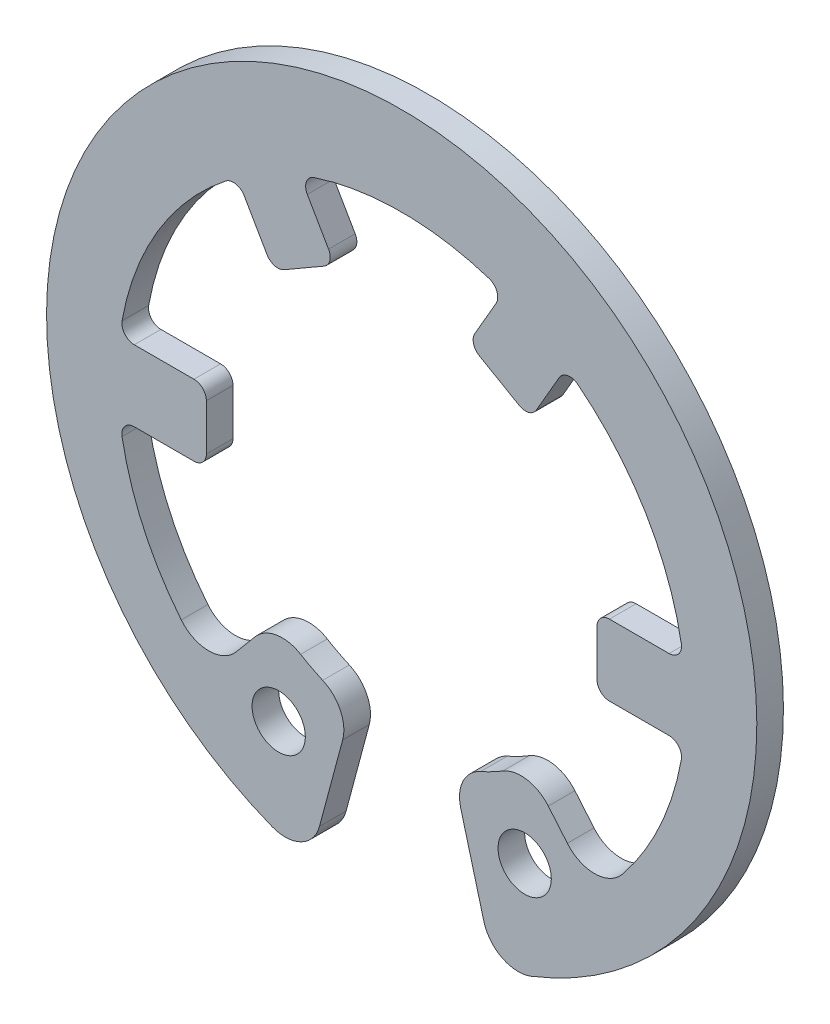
ISO-10303-21;
HEADER;
FILE_DESCRIPTION(('STEP AP214'),'2;1');
FILE_NAME('part.step','',(''),(''),'','','');
FILE_SCHEMA(('AUTOMOTIVE_DESIGN { 1 0 10303 214 1 1 1 1 }'));
ENDSEC;
DATA;
#1=APPLICATION_CONTEXT('core data for automotive mechanical design processes');
#2=APPLICATION_PROTOCOL_DEFINITION('international standard','automotive_design',2000,#1);
#3=PRODUCT_CONTEXT('',#1,'mechanical');
#4=PRODUCT('Part','Part','',(#3));
#5=PRODUCT_RELATED_PRODUCT_CATEGORY('part','',(#4));
#6=PRODUCT_DEFINITION_FORMATION('','',#4);
#7=PRODUCT_DEFINITION_CONTEXT('part definition',#1,'design');
#8=PRODUCT_DEFINITION('design','',#6,#7);
#9=PRODUCT_DEFINITION_SHAPE('','',#8);
#10=(LENGTH_UNIT() NAMED_UNIT(*) SI_UNIT(.MILLI.,.METRE.));
#11=(NAMED_UNIT(*) PLANE_ANGLE_UNIT() SI_UNIT($,.RADIAN.));
#12=(NAMED_UNIT(*) SI_UNIT($,.STERADIAN.) SOLID_ANGLE_UNIT());
#13=UNCERTAINTY_MEASURE_WITH_UNIT(LENGTH_MEASURE(1.E-05),#10,'distance_accuracy_value','');
#14=(GEOMETRIC_REPRESENTATION_CONTEXT(3) GLOBAL_UNCERTAINTY_ASSIGNED_CONTEXT((#13)) GLOBAL_UNIT_ASSIGNED_CONTEXT((#10,
#11,#12)) REPRESENTATION_CONTEXT('',''));
#15=CARTESIAN_POINT('',(0.,0.,0.));
#16=DIRECTION('',(0.,0.,1.));
#17=DIRECTION('',(1.,0.,0.));
#18=AXIS2_PLACEMENT_3D('',#15,#16,#17);
#19=CARTESIAN_POINT('',(-5.43086390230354,-4.91652773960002,0.750000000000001));
#20=DIRECTION('',(0.,0.,-1.));
#21=DIRECTION('',(-1.,0.,0.));
#22=AXIS2_PLACEMENT_3D('',#19,#20,#21);
#23=CYLINDRICAL_SURFACE('',#22,1.);
#24=CARTESIAN_POINT('',(-5.43086390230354,-4.91652773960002,0.));
#25=DIRECTION('',(0.,0.,-1.));
#26=DIRECTION('',(1.,0.,0.));
#27=AXIS2_PLACEMENT_3D('',#24,#25,#26);
#28=CIRCLE('',#27,1.);
#29=CARTESIAN_POINT('',(-4.66481945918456,-5.55931534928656,0.));
#30=VERTEX_POINT('',#29);
#31=CARTESIAN_POINT('',(-6.20670160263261,-5.54746027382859,0.));
#32=VERTEX_POINT('',#31);
#33=EDGE_CURVE('E332',#30,#32,#28,.T.);
#34=ORIENTED_EDGE('',*,*,#33,.T.);
#35=DIRECTION('',(0.,0.,-1.));
#36=VECTOR('',#35,1.);
#37=CARTESIAN_POINT('',(-6.20670160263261,-5.54746027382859,0.750000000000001));
#38=LINE('',#37,#36);
#39=CARTESIAN_POINT('',(-6.20670160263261,-5.54746027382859,0.750000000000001));
#40=VERTEX_POINT('',#39);
#41=EDGE_CURVE('E11',#40,#32,#38,.T.);
#42=ORIENTED_EDGE('',*,*,#41,.F.);
#43=CARTESIAN_POINT('',(-5.43086390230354,-4.91652773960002,0.750000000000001));
#44=DIRECTION('',(0.,0.,-1.));
#45=DIRECTION('',(1.,0.,0.));
#46=AXIS2_PLACEMENT_3D('',#43,#44,#45);
#47=CIRCLE('',#46,1.);
#48=CARTESIAN_POINT('',(-4.66481945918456,-5.55931534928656,0.750000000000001));
#49=VERTEX_POINT('',#48);
#50=EDGE_CURVE('E444',#49,#40,#47,.T.);
#51=ORIENTED_EDGE('',*,*,#50,.F.);
#52=DIRECTION('',(0.,0.,-1.));
#53=VECTOR('',#52,1.);
#54=CARTESIAN_POINT('',(-4.66481945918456,-5.55931534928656,0.750000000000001));
#55=LINE('',#54,#53);
#56=EDGE_CURVE('E345',#49,#30,#55,.T.);
#57=ORIENTED_EDGE('',*,*,#56,.T.);
#58=EDGE_LOOP('',(#34,#42,#51,#57));
#59=FACE_BOUND('',#58,.T.);
#60=ADVANCED_FACE('F24',(#59),#23,.F.);
#61=CARTESIAN_POINT('',(0.,-0.500000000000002,0.750000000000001));
#62=DIRECTION('',(0.,0.,-1.));
#63=DIRECTION('',(-1.,0.,0.));
#64=AXIS2_PLACEMENT_3D('',#61,#62,#63);
#65=CYLINDRICAL_SURFACE('',#64,8.);
#66=CARTESIAN_POINT('',(0.,-0.500000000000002,0.));
#67=DIRECTION('',(0.,0.,-1.));
#68=DIRECTION('',(1.,0.,0.));
#69=AXIS2_PLACEMENT_3D('',#66,#67,#68);
#70=CIRCLE('',#69,8.);
#71=CARTESIAN_POINT('',(-7.87444730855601,-1.91176470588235,0.));
#72=VERTEX_POINT('',#71);
#73=EDGE_CURVE('E328',#32,#72,#70,.T.);
#74=ORIENTED_EDGE('',*,*,#73,.T.);
#75=DIRECTION('',(0.,0.,-1.));
#76=VECTOR('',#75,1.);
#77=CARTESIAN_POINT('',(-7.87444730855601,-1.91176470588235,0.750000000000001));
#78=LINE('',#77,#76);
#79=CARTESIAN_POINT('',(-7.87444730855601,-1.91176470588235,0.750000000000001));
#80=VERTEX_POINT('',#79);
#81=EDGE_CURVE('E31',#80,#72,#78,.T.);
#82=ORIENTED_EDGE('',*,*,#81,.F.);
#83=CARTESIAN_POINT('',(0.,-0.500000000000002,0.750000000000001));
#84=DIRECTION('',(0.,0.,-1.));
#85=DIRECTION('',(1.,0.,0.));
#86=AXIS2_PLACEMENT_3D('',#83,#84,#85);
#87=CIRCLE('',#86,8.);
#88=EDGE_CURVE('E341',#40,#80,#87,.T.);
#89=ORIENTED_EDGE('',*,*,#88,.F.);
#90=ORIENTED_EDGE('',*,*,#41,.T.);
#91=EDGE_LOOP('',(#74,#82,#89,#90));
#92=FACE_BOUND('',#91,.T.);
#93=ADVANCED_FACE('F340',(#92),#65,.F.);
#94=CARTESIAN_POINT('',(-7.52994023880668,-1.85,0.750000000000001));
#95=DIRECTION('',(0.,0.,-1.));
#96=DIRECTION('',(-1.,0.,0.));
#97=AXIS2_PLACEMENT_3D('',#94,#95,#96);
#98=CYLINDRICAL_SURFACE('',#97,0.35);
#99=CARTESIAN_POINT('',(-7.52994023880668,-1.85,0.));
#100=DIRECTION('',(0.,0.,-1.));
#101=DIRECTION('',(-1.,0.,0.));
#102=AXIS2_PLACEMENT_3D('',#99,#100,#101);
#103=CIRCLE('',#102,0.35);
#104=CARTESIAN_POINT('',(-7.52994023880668,-1.5,0.));
#105=VERTEX_POINT('',#104);
#106=EDGE_CURVE('E334',#72,#105,#103,.T.);
#107=ORIENTED_EDGE('',*,*,#106,.T.);
#108=DIRECTION('',(0.,0.,-1.));
#109=VECTOR('',#108,1.);
#110=CARTESIAN_POINT('',(-7.52994023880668,-1.5,0.750000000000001));
#111=LINE('',#110,#109);
#112=CARTESIAN_POINT('',(-7.52994023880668,-1.5,0.750000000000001));
#113=VERTEX_POINT('',#112);
#114=EDGE_CURVE('E670',#113,#105,#111,.T.);
#115=ORIENTED_EDGE('',*,*,#114,.F.);
#116=CARTESIAN_POINT('',(-7.52994023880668,-1.85,0.750000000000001));
#117=DIRECTION('',(0.,0.,-1.));
#118=DIRECTION('',(-1.,0.,0.));
#119=AXIS2_PLACEMENT_3D('',#116,#117,#118);
#120=CIRCLE('',#119,0.35);
#121=EDGE_CURVE('E447',#80,#113,#120,.T.);
#122=ORIENTED_EDGE('',*,*,#121,.F.);
#123=ORIENTED_EDGE('',*,*,#81,.T.);
#124=EDGE_LOOP('',(#107,#115,#122,#123));
#125=FACE_BOUND('',#124,.T.);
#126=ADVANCED_FACE('F674',(#125),#98,.F.);
#127=CARTESIAN_POINT('',(-7.52994023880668,-1.5,0.750000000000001));
#128=DIRECTION('',(0.,1.,0.));
#129=DIRECTION('',(-1.,0.,0.));
#130=AXIS2_PLACEMENT_3D('',#127,#128,#129);
#131=PLANE('',#130);
#132=DIRECTION('',(1.,0.,0.));
#133=VECTOR('',#132,1.);
#134=CARTESIAN_POINT('',(-7.52994023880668,-1.5,0.));
#135=LINE('',#134,#133);
#136=CARTESIAN_POINT('',(-5.85,-1.5,0.));
#137=VERTEX_POINT('',#136);
#138=EDGE_CURVE('E354',#105,#137,#135,.T.);
#139=ORIENTED_EDGE('',*,*,#138,.T.);
#140=DIRECTION('',(0.,0.,-1.));
#141=VECTOR('',#140,1.);
#142=CARTESIAN_POINT('',(-5.85,-1.5,0.750000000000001));
#143=LINE('',#142,#141);
#144=CARTESIAN_POINT('',(-5.85,-1.5,0.750000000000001));
#145=VERTEX_POINT('',#144);
#146=EDGE_CURVE('E667',#145,#137,#143,.T.);
#147=ORIENTED_EDGE('',*,*,#146,.F.);
#148=DIRECTION('',(1.,0.,0.));
#149=VECTOR('',#148,1.);
#150=CARTESIAN_POINT('',(-7.52994023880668,-1.5,0.750000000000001));
#151=LINE('',#150,#149);
#152=EDGE_CURVE('E449',#113,#145,#151,.T.);
#153=ORIENTED_EDGE('',*,*,#152,.F.);
#154=ORIENTED_EDGE('',*,*,#114,.T.);
#155=EDGE_LOOP('',(#139,#147,#153,#154));
#156=FACE_BOUND('',#155,.T.);
#157=ADVANCED_FACE('F682',(#156),#131,.F.);
#158=CARTESIAN_POINT('',(-5.85,-1.15,0.750000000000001));
#159=DIRECTION('',(0.,0.,-1.));
#160=DIRECTION('',(-1.,0.,0.));
#161=AXIS2_PLACEMENT_3D('',#158,#159,#160);
#162=CYLINDRICAL_SURFACE('',#161,0.35);
#163=CARTESIAN_POINT('',(-5.85,-1.15,0.));
#164=DIRECTION('',(0.,0.,1.));
#165=DIRECTION('',(-1.,0.,0.));
#166=AXIS2_PLACEMENT_3D('',#163,#164,#165);
#167=CIRCLE('',#166,0.35);
#168=CARTESIAN_POINT('',(-5.5,-1.15,0.));
#169=VERTEX_POINT('',#168);
#170=EDGE_CURVE('E356',#137,#169,#167,.T.);
#171=ORIENTED_EDGE('',*,*,#170,.T.);
#172=DIRECTION('',(0.,0.,-1.));
#173=VECTOR('',#172,1.);
#174=CARTESIAN_POINT('',(-5.5,-1.15,0.750000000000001));
#175=LINE('',#174,#173);
#176=CARTESIAN_POINT('',(-5.5,-1.15,0.750000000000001));
#177=VERTEX_POINT('',#176);
#178=EDGE_CURVE('E664',#177,#169,#175,.T.);
#179=ORIENTED_EDGE('',*,*,#178,.F.);
#180=CARTESIAN_POINT('',(-5.85,-1.15,0.750000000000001));
#181=DIRECTION('',(0.,0.,1.));
#182=DIRECTION('',(-1.,0.,0.));
#183=AXIS2_PLACEMENT_3D('',#180,#181,#182);
#184=CIRCLE('',#183,0.35);
#185=EDGE_CURVE('E451',#145,#177,#184,.T.);
#186=ORIENTED_EDGE('',*,*,#185,.F.);
#187=ORIENTED_EDGE('',*,*,#146,.T.);
#188=EDGE_LOOP('',(#171,#179,#186,#187));
#189=FACE_BOUND('',#188,.T.);
#190=ADVANCED_FACE('F685',(#189),#162,.T.);
#191=CARTESIAN_POINT('',(-5.5,0.149999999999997,0.750000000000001));
#192=DIRECTION('',(-1.,0.,0.));
#193=DIRECTION('',(0.,0.,1.));
#194=AXIS2_PLACEMENT_3D('',#191,#192,#193);
#195=PLANE('',#194);
#196=DIRECTION('',(0.,1.,0.));
#197=VECTOR('',#196,1.);
#198=CARTESIAN_POINT('',(-5.5,0.149999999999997,0.));
#199=LINE('',#198,#197);
#200=CARTESIAN_POINT('',(-5.5,0.149999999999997,0.));
#201=VERTEX_POINT('',#200);
#202=EDGE_CURVE('E358',#169,#201,#199,.T.);
#203=ORIENTED_EDGE('',*,*,#202,.T.);
#204=DIRECTION('',(0.,0.,-1.));
#205=VECTOR('',#204,1.);
#206=CARTESIAN_POINT('',(-5.5,0.149999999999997,0.750000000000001));
#207=LINE('',#206,#205);
#208=CARTESIAN_POINT('',(-5.5,0.149999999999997,0.750000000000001));
#209=VERTEX_POINT('',#208);
#210=EDGE_CURVE('E661',#209,#201,#207,.T.);
#211=ORIENTED_EDGE('',*,*,#210,.F.);
#212=DIRECTION('',(0.,1.,0.));
#213=VECTOR('',#212,1.);
#214=CARTESIAN_POINT('',(-5.5,0.149999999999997,0.750000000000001));
#215=LINE('',#214,#213);
#216=EDGE_CURVE('E453',#177,#209,#215,.T.);
#217=ORIENTED_EDGE('',*,*,#216,.F.);
#218=ORIENTED_EDGE('',*,*,#178,.T.);
#219=EDGE_LOOP('',(#203,#211,#217,#218));
#220=FACE_BOUND('',#219,.T.);
#221=ADVANCED_FACE('F690',(#220),#195,.F.);
#222=CARTESIAN_POINT('',(-5.85,0.150000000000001,0.750000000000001));
#223=DIRECTION('',(0.,0.,-1.));
#224=DIRECTION('',(-1.,0.,0.));
#225=AXIS2_PLACEMENT_3D('',#222,#223,#224);
#226=CYLINDRICAL_SURFACE('',#225,0.35);
#227=CARTESIAN_POINT('',(-5.85,0.150000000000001,0.));
#228=DIRECTION('',(0.,0.,1.));
#229=DIRECTION('',(1.,0.,0.));
#230=AXIS2_PLACEMENT_3D('',#227,#228,#229);
#231=CIRCLE('',#230,0.35);
#232=CARTESIAN_POINT('',(-5.85,0.499999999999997,0.));
#233=VERTEX_POINT('',#232);
#234=EDGE_CURVE('E360',#201,#233,#231,.T.);
#235=ORIENTED_EDGE('',*,*,#234,.T.);
#236=DIRECTION('',(0.,0.,-1.));
#237=VECTOR('',#236,1.);
#238=CARTESIAN_POINT('',(-5.85,0.499999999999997,0.750000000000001));
#239=LINE('',#238,#237);
#240=CARTESIAN_POINT('',(-5.85,0.499999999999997,0.750000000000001));
#241=VERTEX_POINT('',#240);
#242=EDGE_CURVE('E658',#241,#233,#239,.T.);
#243=ORIENTED_EDGE('',*,*,#242,.F.);
#244=CARTESIAN_POINT('',(-5.85,0.150000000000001,0.750000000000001));
#245=DIRECTION('',(0.,0.,1.));
#246=DIRECTION('',(1.,0.,0.));
#247=AXIS2_PLACEMENT_3D('',#244,#245,#246);
#248=CIRCLE('',#247,0.35);
#249=EDGE_CURVE('E455',#209,#241,#248,.T.);
#250=ORIENTED_EDGE('',*,*,#249,.F.);
#251=ORIENTED_EDGE('',*,*,#210,.T.);
#252=EDGE_LOOP('',(#235,#243,#250,#251));
#253=FACE_BOUND('',#252,.T.);
#254=ADVANCED_FACE('F696',(#253),#226,.T.);
#255=CARTESIAN_POINT('',(-7.52994023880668,0.5,0.750000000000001));
#256=DIRECTION('',(0.,-1.,0.));
#257=DIRECTION('',(0.,0.,-1.));
#258=AXIS2_PLACEMENT_3D('',#255,#256,#257);
#259=PLANE('',#258);
#260=DIRECTION('',(-1.,0.,0.));
#261=VECTOR('',#260,1.);
#262=CARTESIAN_POINT('',(-7.52994023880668,0.5,0.));
#263=LINE('',#262,#261);
#264=CARTESIAN_POINT('',(-7.52994023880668,0.5,0.));
#265=VERTEX_POINT('',#264);
#266=EDGE_CURVE('E362',#233,#265,#263,.T.);
#267=ORIENTED_EDGE('',*,*,#266,.T.);
#268=DIRECTION('',(0.,0.,-1.));
#269=VECTOR('',#268,1.);
#270=CARTESIAN_POINT('',(-7.52994023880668,0.5,0.750000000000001));
#271=LINE('',#270,#269);
#272=CARTESIAN_POINT('',(-7.52994023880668,0.5,0.750000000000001));
#273=VERTEX_POINT('',#272);
#274=EDGE_CURVE('E655',#273,#265,#271,.T.);
#275=ORIENTED_EDGE('',*,*,#274,.F.);
#276=DIRECTION('',(-1.,0.,0.));
#277=VECTOR('',#276,1.);
#278=CARTESIAN_POINT('',(-7.52994023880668,0.5,0.750000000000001));
#279=LINE('',#278,#277);
#280=EDGE_CURVE('E457',#241,#273,#279,.T.);
#281=ORIENTED_EDGE('',*,*,#280,.F.);
#282=ORIENTED_EDGE('',*,*,#242,.T.);
#283=EDGE_LOOP('',(#267,#275,#281,#282));
#284=FACE_BOUND('',#283,.T.);
#285=ADVANCED_FACE('F700',(#284),#259,.F.);
#286=CARTESIAN_POINT('',(-7.52994023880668,0.85,0.750000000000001));
#287=DIRECTION('',(0.,0.,-1.));
#288=DIRECTION('',(-1.,0.,0.));
#289=AXIS2_PLACEMENT_3D('',#286,#287,#288);
#290=CYLINDRICAL_SURFACE('',#289,0.35);
#291=CARTESIAN_POINT('',(-7.52994023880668,0.85,0.));
#292=DIRECTION('',(0.,0.,-1.));
#293=DIRECTION('',(1.,0.,0.));
#294=AXIS2_PLACEMENT_3D('',#291,#292,#293);
#295=CIRCLE('',#294,0.35);
#296=CARTESIAN_POINT('',(-7.87444730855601,0.911764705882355,0.));
#297=VERTEX_POINT('',#296);
#298=EDGE_CURVE('E364',#265,#297,#295,.T.);
#299=ORIENTED_EDGE('',*,*,#298,.T.);
#300=DIRECTION('',(0.,0.,-1.));
#301=VECTOR('',#300,1.);
#302=CARTESIAN_POINT('',(-7.87444730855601,0.911764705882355,0.750000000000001));
#303=LINE('',#302,#301);
#304=CARTESIAN_POINT('',(-7.87444730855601,0.911764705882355,0.750000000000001));
#305=VERTEX_POINT('',#304);
#306=EDGE_CURVE('E652',#305,#297,#303,.T.);
#307=ORIENTED_EDGE('',*,*,#306,.F.);
#308=CARTESIAN_POINT('',(-7.52994023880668,0.85,0.750000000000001));
#309=DIRECTION('',(0.,0.,-1.));
#310=DIRECTION('',(1.,0.,0.));
#311=AXIS2_PLACEMENT_3D('',#308,#309,#310);
#312=CIRCLE('',#311,0.35);
#313=EDGE_CURVE('E459',#273,#305,#312,.T.);
#314=ORIENTED_EDGE('',*,*,#313,.F.);
#315=ORIENTED_EDGE('',*,*,#274,.T.);
#316=EDGE_LOOP('',(#299,#307,#314,#315));
#317=FACE_BOUND('',#316,.T.);
#318=ADVANCED_FACE('F705',(#317),#290,.F.);
#319=CARTESIAN_POINT('',(0.,-0.500000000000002,0.750000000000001));
#320=DIRECTION('',(0.,0.,-1.));
#321=DIRECTION('',(-1.,0.,0.));
#322=AXIS2_PLACEMENT_3D('',#319,#320,#321);
#323=CYLINDRICAL_SURFACE('',#322,8.);
#324=CARTESIAN_POINT('',(0.,-0.500000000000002,0.));
#325=DIRECTION('',(0.,0.,-1.));
#326=DIRECTION('',(1.,0.,0.));
#327=AXIS2_PLACEMENT_3D('',#324,#325,#326);
#328=CIRCLE('',#327,8.);
#329=CARTESIAN_POINT('',(-4.95464462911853,5.78104263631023,0.));
#330=VERTEX_POINT('',#329);
#331=EDGE_CURVE('E366',#297,#330,#328,.T.);
#332=ORIENTED_EDGE('',*,*,#331,.T.);
#333=DIRECTION('',(0.,0.,-1.));
#334=VECTOR('',#333,1.);
#335=CARTESIAN_POINT('',(-4.95464462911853,5.78104263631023,0.750000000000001));
#336=LINE('',#335,#334);
#337=CARTESIAN_POINT('',(-4.95464462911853,5.78104263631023,0.750000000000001));
#338=VERTEX_POINT('',#337);
#339=EDGE_CURVE('E649',#338,#330,#336,.T.);
#340=ORIENTED_EDGE('',*,*,#339,.F.);
#341=CARTESIAN_POINT('',(0.,-0.500000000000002,0.750000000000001));
#342=DIRECTION('',(0.,0.,-1.));
#343=DIRECTION('',(1.,0.,0.));
#344=AXIS2_PLACEMENT_3D('',#341,#342,#343);
#345=CIRCLE('',#344,8.);
#346=EDGE_CURVE('E461',#305,#338,#345,.T.);
#347=ORIENTED_EDGE('',*,*,#346,.F.);
#348=ORIENTED_EDGE('',*,*,#306,.T.);
#349=EDGE_LOOP('',(#332,#340,#347,#348));
#350=FACE_BOUND('',#349,.T.);
#351=ADVANCED_FACE('F711',(#350),#323,.F.);
#352=CARTESIAN_POINT('',(-4.7378789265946,5.50624702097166,0.750000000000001));
#353=DIRECTION('',(0.,0.,-1.));
#354=DIRECTION('',(-1.,0.,0.));
#355=AXIS2_PLACEMENT_3D('',#352,#353,#354);
#356=CYLINDRICAL_SURFACE('',#355,0.349999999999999);
#357=CARTESIAN_POINT('',(-4.7378789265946,5.50624702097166,0.));
#358=DIRECTION('',(0.,0.,-1.));
#359=DIRECTION('',(-1.,0.,0.));
#360=AXIS2_PLACEMENT_3D('',#357,#358,#359);
#361=CIRCLE('',#360,0.349999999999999);
#362=CARTESIAN_POINT('',(-4.43477003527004,5.68124702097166,0.));
#363=VERTEX_POINT('',#362);
#364=EDGE_CURVE('E368',#330,#363,#361,.T.);
#365=ORIENTED_EDGE('',*,*,#364,.T.);
#366=DIRECTION('',(0.,0.,-1.));
#367=VECTOR('',#366,1.);
#368=CARTESIAN_POINT('',(-4.43477003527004,5.68124702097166,0.750000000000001));
#369=LINE('',#368,#367);
#370=CARTESIAN_POINT('',(-4.43477003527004,5.68124702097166,0.750000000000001));
#371=VERTEX_POINT('',#370);
#372=EDGE_CURVE('E646',#371,#363,#369,.T.);
#373=ORIENTED_EDGE('',*,*,#372,.F.);
#374=CARTESIAN_POINT('',(-4.7378789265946,5.50624702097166,0.750000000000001));
#375=DIRECTION('',(0.,0.,-1.));
#376=DIRECTION('',(-1.,0.,0.));
#377=AXIS2_PLACEMENT_3D('',#374,#375,#376);
#378=CIRCLE('',#377,0.349999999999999);
#379=EDGE_CURVE('E463',#338,#371,#378,.T.);
#380=ORIENTED_EDGE('',*,*,#379,.F.);
#381=ORIENTED_EDGE('',*,*,#339,.T.);
#382=EDGE_LOOP('',(#365,#373,#380,#381));
#383=FACE_BOUND('',#382,.T.);
#384=ADVANCED_FACE('F715',(#383),#356,.F.);
#385=CARTESIAN_POINT('',(-4.43477003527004,5.68124702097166,0.750000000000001));
#386=DIRECTION('',(0.866025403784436,0.500000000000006,0.));
#387=DIRECTION('',(-0.500000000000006,0.866025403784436,0.));
#388=AXIS2_PLACEMENT_3D('',#385,#386,#387);
#389=PLANE('',#388);
#390=DIRECTION('',(0.500000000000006,-0.866025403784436,0.));
#391=VECTOR('',#390,1.);
#392=CARTESIAN_POINT('',(-4.43477003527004,5.68124702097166,0.));
#393=LINE('',#392,#391);
#394=CARTESIAN_POINT('',(-3.79102540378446,4.56624861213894,0.));
#395=VERTEX_POINT('',#394);
#396=EDGE_CURVE('E370',#363,#395,#393,.T.);
#397=ORIENTED_EDGE('',*,*,#396,.T.);
#398=DIRECTION('',(0.,0.,-1.));
#399=VECTOR('',#398,1.);
#400=CARTESIAN_POINT('',(-3.79102540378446,4.56624861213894,0.750000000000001));
#401=LINE('',#400,#399);
#402=CARTESIAN_POINT('',(-3.79102540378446,4.56624861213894,0.750000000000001));
#403=VERTEX_POINT('',#402);
#404=EDGE_CURVE('E643',#403,#395,#401,.T.);
#405=ORIENTED_EDGE('',*,*,#404,.F.);
#406=DIRECTION('',(0.500000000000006,-0.866025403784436,0.));
#407=VECTOR('',#406,1.);
#408=CARTESIAN_POINT('',(-4.43477003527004,5.68124702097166,0.750000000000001));
#409=LINE('',#408,#407);
#410=EDGE_CURVE('E465',#371,#403,#409,.T.);
#411=ORIENTED_EDGE('',*,*,#410,.F.);
#412=ORIENTED_EDGE('',*,*,#372,.T.);
#413=EDGE_LOOP('',(#397,#405,#411,#412));
#414=FACE_BOUND('',#413,.T.);
#415=ADVANCED_FACE('F720',(#414),#389,.F.);
#416=CARTESIAN_POINT('',(-3.48791651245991,4.74124861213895,0.750000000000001));
#417=DIRECTION('',(0.,0.,-1.));
#418=DIRECTION('',(-1.,0.,0.));
#419=AXIS2_PLACEMENT_3D('',#416,#417,#418);
#420=CYLINDRICAL_SURFACE('',#419,0.349999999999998);
#421=CARTESIAN_POINT('',(-3.48791651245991,4.74124861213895,0.));
#422=DIRECTION('',(0.,0.,1.));
#423=DIRECTION('',(-1.,0.,0.));
#424=AXIS2_PLACEMENT_3D('',#421,#422,#423);
#425=CIRCLE('',#424,0.349999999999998);
#426=CARTESIAN_POINT('',(-3.31291651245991,4.4381397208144,0.));
#427=VERTEX_POINT('',#426);
#428=EDGE_CURVE('E372',#395,#427,#425,.T.);
#429=ORIENTED_EDGE('',*,*,#428,.T.);
#430=DIRECTION('',(0.,0.,-1.));
#431=VECTOR('',#430,1.);
#432=CARTESIAN_POINT('',(-3.31291651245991,4.4381397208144,0.750000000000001));
#433=LINE('',#432,#431);
#434=CARTESIAN_POINT('',(-3.31291651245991,4.4381397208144,0.750000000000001));
#435=VERTEX_POINT('',#434);
#436=EDGE_CURVE('E640',#435,#427,#433,.T.);
#437=ORIENTED_EDGE('',*,*,#436,.F.);
#438=CARTESIAN_POINT('',(-3.48791651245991,4.74124861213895,0.750000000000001));
#439=DIRECTION('',(0.,0.,1.));
#440=DIRECTION('',(-1.,0.,0.));
#441=AXIS2_PLACEMENT_3D('',#438,#439,#440);
#442=CIRCLE('',#441,0.349999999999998);
#443=EDGE_CURVE('E467',#403,#435,#442,.T.);
#444=ORIENTED_EDGE('',*,*,#443,.F.);
#445=ORIENTED_EDGE('',*,*,#404,.T.);
#446=EDGE_LOOP('',(#429,#437,#444,#445));
#447=FACE_BOUND('',#446,.T.);
#448=ADVANCED_FACE('F726',(#447),#420,.T.);
#449=CARTESIAN_POINT('',(-3.31291651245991,4.4381397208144,0.750000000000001));
#450=DIRECTION('',(-0.500000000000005,0.866025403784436,0.));
#451=DIRECTION('',(-0.866025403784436,-0.500000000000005,0.));
#452=AXIS2_PLACEMENT_3D('',#449,#450,#451);
#453=PLANE('',#452);
#454=DIRECTION('',(0.866025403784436,0.500000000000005,0.));
#455=VECTOR('',#454,1.);
#456=CARTESIAN_POINT('',(-3.31291651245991,4.4381397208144,0.));
#457=LINE('',#456,#455);
#458=CARTESIAN_POINT('',(-2.18708348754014,5.0881397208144,0.));
#459=VERTEX_POINT('',#458);
#460=EDGE_CURVE('E374',#427,#459,#457,.T.);
#461=ORIENTED_EDGE('',*,*,#460,.T.);
#462=DIRECTION('',(0.,0.,-1.));
#463=VECTOR('',#462,1.);
#464=CARTESIAN_POINT('',(-2.18708348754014,5.0881397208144,0.750000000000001));
#465=LINE('',#464,#463);
#466=CARTESIAN_POINT('',(-2.18708348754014,5.0881397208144,0.750000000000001));
#467=VERTEX_POINT('',#466);
#468=EDGE_CURVE('E637',#467,#459,#465,.T.);
#469=ORIENTED_EDGE('',*,*,#468,.F.);
#470=DIRECTION('',(0.866025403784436,0.500000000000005,0.));
#471=VECTOR('',#470,1.);
#472=CARTESIAN_POINT('',(-3.31291651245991,4.4381397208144,0.750000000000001));
#473=LINE('',#472,#471);
#474=EDGE_CURVE('E469',#435,#467,#473,.T.);
#475=ORIENTED_EDGE('',*,*,#474,.F.);
#476=ORIENTED_EDGE('',*,*,#436,.T.);
#477=EDGE_LOOP('',(#461,#469,#475,#476));
#478=FACE_BOUND('',#477,.T.);
#479=ADVANCED_FACE('F730',(#478),#453,.F.);
#480=CARTESIAN_POINT('',(-2.36208348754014,5.39124861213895,0.750000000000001));
#481=DIRECTION('',(0.,0.,-1.));
#482=DIRECTION('',(-1.,0.,0.));
#483=AXIS2_PLACEMENT_3D('',#480,#481,#482);
#484=CYLINDRICAL_SURFACE('',#483,0.349999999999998);
#485=CARTESIAN_POINT('',(-2.36208348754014,5.39124861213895,0.));
#486=DIRECTION('',(0.,0.,1.));
#487=DIRECTION('',(1.,0.,0.));
#488=AXIS2_PLACEMENT_3D('',#485,#486,#487);
#489=CIRCLE('',#488,0.349999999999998);
#490=CARTESIAN_POINT('',(-2.05897459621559,5.56624861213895,0.));
#491=VERTEX_POINT('',#490);
#492=EDGE_CURVE('E376',#459,#491,#489,.T.);
#493=ORIENTED_EDGE('',*,*,#492,.T.);
#494=DIRECTION('',(0.,0.,-1.));
#495=VECTOR('',#494,1.);
#496=CARTESIAN_POINT('',(-2.05897459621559,5.56624861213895,0.750000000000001));
#497=LINE('',#496,#495);
#498=CARTESIAN_POINT('',(-2.05897459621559,5.56624861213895,0.750000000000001));
#499=VERTEX_POINT('',#498);
#500=EDGE_CURVE('E634',#499,#491,#497,.T.);
#501=ORIENTED_EDGE('',*,*,#500,.F.);
#502=CARTESIAN_POINT('',(-2.36208348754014,5.39124861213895,0.750000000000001));
#503=DIRECTION('',(0.,0.,1.));
#504=DIRECTION('',(1.,0.,0.));
#505=AXIS2_PLACEMENT_3D('',#502,#503,#504);
#506=CIRCLE('',#505,0.349999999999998);
#507=EDGE_CURVE('E471',#467,#499,#506,.T.);
#508=ORIENTED_EDGE('',*,*,#507,.F.);
#509=ORIENTED_EDGE('',*,*,#468,.T.);
#510=EDGE_LOOP('',(#493,#501,#508,#509));
#511=FACE_BOUND('',#510,.T.);
#512=ADVANCED_FACE('F735',(#511),#484,.T.);
#513=CARTESIAN_POINT('',(-2.65787263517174,6.60357044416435,0.750000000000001));
#514=DIRECTION('',(-0.866025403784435,-0.500000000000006,0.));
#515=DIRECTION('',(0.500000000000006,-0.866025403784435,0.));
#516=AXIS2_PLACEMENT_3D('',#513,#514,#515);
#517=PLANE('',#516);
#518=DIRECTION('',(-0.500000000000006,0.866025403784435,0.));
#519=VECTOR('',#518,1.);
#520=CARTESIAN_POINT('',(-2.65787263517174,6.60357044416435,0.));
#521=LINE('',#520,#519);
#522=CARTESIAN_POINT('',(-2.65787263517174,6.60357044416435,0.));
#523=VERTEX_POINT('',#522);
#524=EDGE_CURVE('E378',#491,#523,#521,.T.);
#525=ORIENTED_EDGE('',*,*,#524,.T.);
#526=DIRECTION('',(0.,0.,-1.));
#527=VECTOR('',#526,1.);
#528=CARTESIAN_POINT('',(-2.65787263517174,6.60357044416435,0.750000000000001));
#529=LINE('',#528,#527);
#530=CARTESIAN_POINT('',(-2.65787263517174,6.60357044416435,0.750000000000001));
#531=VERTEX_POINT('',#530);
#532=EDGE_CURVE('E631',#531,#523,#529,.T.);
#533=ORIENTED_EDGE('',*,*,#532,.F.);
#534=DIRECTION('',(-0.500000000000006,0.866025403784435,0.));
#535=VECTOR('',#534,1.);
#536=CARTESIAN_POINT('',(-2.65787263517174,6.60357044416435,0.750000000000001));
#537=LINE('',#536,#535);
#538=EDGE_CURVE('E473',#499,#531,#537,.T.);
#539=ORIENTED_EDGE('',*,*,#538,.F.);
#540=ORIENTED_EDGE('',*,*,#500,.T.);
#541=EDGE_LOOP('',(#525,#533,#539,#540));
#542=FACE_BOUND('',#541,.T.);
#543=ADVANCED_FACE('F741',(#542),#517,.F.);
#544=CARTESIAN_POINT('',(-2.35476374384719,6.77857044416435,0.750000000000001));
#545=DIRECTION('',(0.,0.,-1.));
#546=DIRECTION('',(-1.,0.,0.));
#547=AXIS2_PLACEMENT_3D('',#544,#545,#546);
#548=CYLINDRICAL_SURFACE('',#547,0.35);
#549=CARTESIAN_POINT('',(-2.35476374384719,6.77857044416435,0.));
#550=DIRECTION('',(0.,0.,-1.));
#551=DIRECTION('',(-1.,0.,0.));
#552=AXIS2_PLACEMENT_3D('',#549,#550,#551);
#553=CIRCLE('',#552,0.35);
#554=CARTESIAN_POINT('',(-2.46249803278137,7.11157693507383,0.));
#555=VERTEX_POINT('',#554);
#556=EDGE_CURVE('E380',#523,#555,#553,.T.);
#557=ORIENTED_EDGE('',*,*,#556,.T.);
#558=DIRECTION('',(0.,0.,-1.));
#559=VECTOR('',#558,1.);
#560=CARTESIAN_POINT('',(-2.46249803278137,7.11157693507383,0.750000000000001));
#561=LINE('',#560,#559);
#562=CARTESIAN_POINT('',(-2.46249803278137,7.11157693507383,0.750000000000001));
#563=VERTEX_POINT('',#562);
#564=EDGE_CURVE('E628',#563,#555,#561,.T.);
#565=ORIENTED_EDGE('',*,*,#564,.F.);
#566=CARTESIAN_POINT('',(-2.35476374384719,6.77857044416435,0.750000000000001));
#567=DIRECTION('',(0.,0.,-1.));
#568=DIRECTION('',(-1.,0.,0.));
#569=AXIS2_PLACEMENT_3D('',#566,#567,#568);
#570=CIRCLE('',#569,0.35);
#571=EDGE_CURVE('E475',#531,#563,#570,.T.);
#572=ORIENTED_EDGE('',*,*,#571,.F.);
#573=ORIENTED_EDGE('',*,*,#532,.T.);
#574=EDGE_LOOP('',(#557,#565,#572,#573));
#575=FACE_BOUND('',#574,.T.);
#576=ADVANCED_FACE('F745',(#575),#548,.F.);
#577=CARTESIAN_POINT('',(0.,-0.500000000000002,0.750000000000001));
#578=DIRECTION('',(0.,0.,-1.));
#579=DIRECTION('',(-1.,0.,0.));
#580=AXIS2_PLACEMENT_3D('',#577,#578,#579);
#581=CYLINDRICAL_SURFACE('',#580,8.);
#582=CARTESIAN_POINT('',(0.,-0.500000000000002,0.));
#583=DIRECTION('',(0.,0.,-1.));
#584=DIRECTION('',(1.,0.,0.));
#585=AXIS2_PLACEMENT_3D('',#582,#583,#584);
#586=CIRCLE('',#585,8.);
#587=CARTESIAN_POINT('',(2.46249803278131,7.11157693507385,0.));
#588=VERTEX_POINT('',#587);
#589=EDGE_CURVE('E382',#555,#588,#586,.T.);
#590=ORIENTED_EDGE('',*,*,#589,.T.);
#591=DIRECTION('',(0.,0.,-1.));
#592=VECTOR('',#591,1.);
#593=CARTESIAN_POINT('',(2.46249803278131,7.11157693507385,0.750000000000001));
#594=LINE('',#593,#592);
#595=CARTESIAN_POINT('',(2.46249803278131,7.11157693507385,0.750000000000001));
#596=VERTEX_POINT('',#595);
#597=EDGE_CURVE('E625',#596,#588,#594,.T.);
#598=ORIENTED_EDGE('',*,*,#597,.F.);
#599=CARTESIAN_POINT('',(0.,-0.500000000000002,0.750000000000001));
#600=DIRECTION('',(0.,0.,-1.));
#601=DIRECTION('',(1.,0.,0.));
#602=AXIS2_PLACEMENT_3D('',#599,#600,#601);
#603=CIRCLE('',#602,8.);
#604=EDGE_CURVE('E477',#563,#596,#603,.T.);
#605=ORIENTED_EDGE('',*,*,#604,.F.);
#606=ORIENTED_EDGE('',*,*,#564,.T.);
#607=EDGE_LOOP('',(#590,#598,#605,#606));
#608=FACE_BOUND('',#607,.T.);
#609=ADVANCED_FACE('F750',(#608),#581,.F.);
#610=CARTESIAN_POINT('',(2.35476374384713,6.77857044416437,0.750000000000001));
#611=DIRECTION('',(0.,0.,-1.));
#612=DIRECTION('',(-1.,0.,0.));
#613=AXIS2_PLACEMENT_3D('',#610,#611,#612);
#614=CYLINDRICAL_SURFACE('',#613,0.349999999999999);
#615=CARTESIAN_POINT('',(2.35476374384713,6.77857044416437,0.));
#616=DIRECTION('',(0.,0.,-1.));
#617=DIRECTION('',(-1.,0.,0.));
#618=AXIS2_PLACEMENT_3D('',#615,#616,#617);
#619=CIRCLE('',#618,0.349999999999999);
#620=CARTESIAN_POINT('',(2.65787263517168,6.60357044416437,0.));
#621=VERTEX_POINT('',#620);
#622=EDGE_CURVE('E384',#588,#621,#619,.T.);
#623=ORIENTED_EDGE('',*,*,#622,.T.);
#624=DIRECTION('',(0.,0.,-1.));
#625=VECTOR('',#624,1.);
#626=CARTESIAN_POINT('',(2.65787263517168,6.60357044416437,0.750000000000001));
#627=LINE('',#626,#625);
#628=CARTESIAN_POINT('',(2.65787263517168,6.60357044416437,0.750000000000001));
#629=VERTEX_POINT('',#628);
#630=EDGE_CURVE('E622',#629,#621,#627,.T.);
#631=ORIENTED_EDGE('',*,*,#630,.F.);
#632=CARTESIAN_POINT('',(2.35476374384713,6.77857044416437,0.750000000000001));
#633=DIRECTION('',(0.,0.,-1.));
#634=DIRECTION('',(-1.,0.,0.));
#635=AXIS2_PLACEMENT_3D('',#632,#633,#634);
#636=CIRCLE('',#635,0.349999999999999);
#637=EDGE_CURVE('E479',#596,#629,#636,.T.);
#638=ORIENTED_EDGE('',*,*,#637,.F.);
#639=ORIENTED_EDGE('',*,*,#597,.T.);
#640=EDGE_LOOP('',(#623,#631,#638,#639));
#641=FACE_BOUND('',#640,.T.);
#642=ADVANCED_FACE('F756',(#641),#614,.F.);
#643=CARTESIAN_POINT('',(2.65787263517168,6.60357044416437,0.750000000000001));
#644=DIRECTION('',(0.86602540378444,-0.499999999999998,0.));
#645=DIRECTION('',(0.499999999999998,0.86602540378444,0.));
#646=AXIS2_PLACEMENT_3D('',#643,#644,#645);
#647=PLANE('',#646);
#648=DIRECTION('',(-0.499999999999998,-0.86602540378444,0.));
#649=VECTOR('',#648,1.);
#650=CARTESIAN_POINT('',(2.65787263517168,6.60357044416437,0.));
#651=LINE('',#650,#649);
#652=CARTESIAN_POINT('',(2.05897459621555,5.56624861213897,0.));
#653=VERTEX_POINT('',#652);
#654=EDGE_CURVE('E386',#621,#653,#651,.T.);
#655=ORIENTED_EDGE('',*,*,#654,.T.);
#656=DIRECTION('',(0.,0.,-1.));
#657=VECTOR('',#656,1.);
#658=CARTESIAN_POINT('',(2.05897459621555,5.56624861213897,0.750000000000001));
#659=LINE('',#658,#657);
#660=CARTESIAN_POINT('',(2.05897459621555,5.56624861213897,0.750000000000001));
#661=VERTEX_POINT('',#660);
#662=EDGE_CURVE('E619',#661,#653,#659,.T.);
#663=ORIENTED_EDGE('',*,*,#662,.F.);
#664=DIRECTION('',(-0.499999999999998,-0.86602540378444,0.));
#665=VECTOR('',#664,1.);
#666=CARTESIAN_POINT('',(2.65787263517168,6.60357044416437,0.750000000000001));
#667=LINE('',#666,#665);
#668=EDGE_CURVE('E481',#629,#661,#667,.T.);
#669=ORIENTED_EDGE('',*,*,#668,.F.);
#670=ORIENTED_EDGE('',*,*,#630,.T.);
#671=EDGE_LOOP('',(#655,#663,#669,#670));
#672=FACE_BOUND('',#671,.T.);
#673=ADVANCED_FACE('F760',(#672),#647,.F.);
#674=CARTESIAN_POINT('',(2.3620834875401,5.39124861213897,0.750000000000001));
#675=DIRECTION('',(0.,0.,-1.));
#676=DIRECTION('',(-1.,0.,0.));
#677=AXIS2_PLACEMENT_3D('',#674,#675,#676);
#678=CYLINDRICAL_SURFACE('',#677,0.35);
#679=CARTESIAN_POINT('',(2.3620834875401,5.39124861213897,0.));
#680=DIRECTION('',(0.,0.,1.));
#681=DIRECTION('',(-1.,0.,0.));
#682=AXIS2_PLACEMENT_3D('',#679,#680,#681);
#683=CIRCLE('',#682,0.35);
#684=CARTESIAN_POINT('',(2.1870834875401,5.08813972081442,0.));
#685=VERTEX_POINT('',#684);
#686=EDGE_CURVE('E388',#653,#685,#683,.T.);
#687=ORIENTED_EDGE('',*,*,#686,.T.);
#688=DIRECTION('',(0.,0.,-1.));
#689=VECTOR('',#688,1.);
#690=CARTESIAN_POINT('',(2.1870834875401,5.08813972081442,0.750000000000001));
#691=LINE('',#690,#689);
#692=CARTESIAN_POINT('',(2.1870834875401,5.08813972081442,0.750000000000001));
#693=VERTEX_POINT('',#692);
#694=EDGE_CURVE('E616',#693,#685,#691,.T.);
#695=ORIENTED_EDGE('',*,*,#694,.F.);
#696=CARTESIAN_POINT('',(2.3620834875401,5.39124861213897,0.750000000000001));
#697=DIRECTION('',(0.,0.,1.));
#698=DIRECTION('',(-1.,0.,0.));
#699=AXIS2_PLACEMENT_3D('',#696,#697,#698);
#700=CIRCLE('',#699,0.35);
#701=EDGE_CURVE('E483',#661,#693,#700,.T.);
#702=ORIENTED_EDGE('',*,*,#701,.F.);
#703=ORIENTED_EDGE('',*,*,#662,.T.);
#704=EDGE_LOOP('',(#687,#695,#702,#703));
#705=FACE_BOUND('',#704,.T.);
#706=ADVANCED_FACE('F765',(#705),#678,.T.);
#707=CARTESIAN_POINT('',(2.1870834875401,5.08813972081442,0.750000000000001));
#708=DIRECTION('',(0.499999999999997,0.86602540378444,0.));
#709=DIRECTION('',(-0.86602540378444,0.499999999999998,0.));
#710=AXIS2_PLACEMENT_3D('',#707,#708,#709);
#711=PLANE('',#710);
#712=DIRECTION('',(0.86602540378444,-0.499999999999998,0.));
#713=VECTOR('',#712,1.);
#714=CARTESIAN_POINT('',(2.1870834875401,5.08813972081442,0.));
#715=LINE('',#714,#713);
#716=CARTESIAN_POINT('',(3.31291651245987,4.43813972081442,0.));
#717=VERTEX_POINT('',#716);
#718=EDGE_CURVE('E390',#685,#717,#715,.T.);
#719=ORIENTED_EDGE('',*,*,#718,.T.);
#720=DIRECTION('',(0.,0.,-1.));
#721=VECTOR('',#720,1.);
#722=CARTESIAN_POINT('',(3.31291651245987,4.43813972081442,0.750000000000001));
#723=LINE('',#722,#721);
#724=CARTESIAN_POINT('',(3.31291651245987,4.43813972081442,0.750000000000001));
#725=VERTEX_POINT('',#724);
#726=EDGE_CURVE('E613',#725,#717,#723,.T.);
#727=ORIENTED_EDGE('',*,*,#726,.F.);
#728=DIRECTION('',(0.86602540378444,-0.499999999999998,0.));
#729=VECTOR('',#728,1.);
#730=CARTESIAN_POINT('',(2.1870834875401,5.08813972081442,0.750000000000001));
#731=LINE('',#730,#729);
#732=EDGE_CURVE('E485',#693,#725,#731,.T.);
#733=ORIENTED_EDGE('',*,*,#732,.F.);
#734=ORIENTED_EDGE('',*,*,#694,.T.);
#735=EDGE_LOOP('',(#719,#727,#733,#734));
#736=FACE_BOUND('',#735,.T.);
#737=ADVANCED_FACE('F771',(#736),#711,.F.);
#738=CARTESIAN_POINT('',(3.48791651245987,4.74124861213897,0.750000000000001));
#739=DIRECTION('',(0.,0.,-1.));
#740=DIRECTION('',(-1.,0.,0.));
#741=AXIS2_PLACEMENT_3D('',#738,#739,#740);
#742=CYLINDRICAL_SURFACE('',#741,0.35);
#743=CARTESIAN_POINT('',(3.48791651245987,4.74124861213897,0.));
#744=DIRECTION('',(0.,0.,1.));
#745=DIRECTION('',(1.,0.,0.));
#746=AXIS2_PLACEMENT_3D('',#743,#744,#745);
#747=CIRCLE('',#746,0.35);
#748=CARTESIAN_POINT('',(3.79102540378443,4.56624861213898,0.));
#749=VERTEX_POINT('',#748);
#750=EDGE_CURVE('E392',#717,#749,#747,.T.);
#751=ORIENTED_EDGE('',*,*,#750,.T.);
#752=DIRECTION('',(0.,0.,-1.));
#753=VECTOR('',#752,1.);
#754=CARTESIAN_POINT('',(3.79102540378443,4.56624861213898,0.750000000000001));
#755=LINE('',#754,#753);
#756=CARTESIAN_POINT('',(3.79102540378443,4.56624861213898,0.750000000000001));
#757=VERTEX_POINT('',#756);
#758=EDGE_CURVE('E610',#757,#749,#755,.T.);
#759=ORIENTED_EDGE('',*,*,#758,.F.);
#760=CARTESIAN_POINT('',(3.48791651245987,4.74124861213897,0.750000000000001));
#761=DIRECTION('',(0.,0.,1.));
#762=DIRECTION('',(1.,0.,0.));
#763=AXIS2_PLACEMENT_3D('',#760,#761,#762);
#764=CIRCLE('',#763,0.35);
#765=EDGE_CURVE('E487',#725,#757,#764,.T.);
#766=ORIENTED_EDGE('',*,*,#765,.F.);
#767=ORIENTED_EDGE('',*,*,#726,.T.);
#768=EDGE_LOOP('',(#751,#759,#766,#767));
#769=FACE_BOUND('',#768,.T.);
#770=ADVANCED_FACE('F775',(#769),#742,.T.);
#771=CARTESIAN_POINT('',(4.43477003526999,5.68124702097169,0.750000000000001));
#772=DIRECTION('',(-0.866025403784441,0.499999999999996,0.));
#773=DIRECTION('',(-0.499999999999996,-0.866025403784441,0.));
#774=AXIS2_PLACEMENT_3D('',#771,#772,#773);
#775=PLANE('',#774);
#776=DIRECTION('',(0.499999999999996,0.866025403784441,0.));
#777=VECTOR('',#776,1.);
#778=CARTESIAN_POINT('',(4.43477003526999,5.68124702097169,0.));
#779=LINE('',#778,#777);
#780=CARTESIAN_POINT('',(4.43477003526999,5.68124702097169,0.));
#781=VERTEX_POINT('',#780);
#782=EDGE_CURVE('E394',#749,#781,#779,.T.);
#783=ORIENTED_EDGE('',*,*,#782,.T.);
#784=DIRECTION('',(0.,0.,-1.));
#785=VECTOR('',#784,1.);
#786=CARTESIAN_POINT('',(4.43477003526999,5.68124702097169,0.750000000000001));
#787=LINE('',#786,#785);
#788=CARTESIAN_POINT('',(4.43477003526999,5.68124702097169,0.750000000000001));
#789=VERTEX_POINT('',#788);
#790=EDGE_CURVE('E607',#789,#781,#787,.T.);
#791=ORIENTED_EDGE('',*,*,#790,.F.);
#792=DIRECTION('',(0.499999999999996,0.866025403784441,0.));
#793=VECTOR('',#792,1.);
#794=CARTESIAN_POINT('',(4.43477003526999,5.68124702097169,0.750000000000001));
#795=LINE('',#794,#793);
#796=EDGE_CURVE('E489',#757,#789,#795,.T.);
#797=ORIENTED_EDGE('',*,*,#796,.F.);
#798=ORIENTED_EDGE('',*,*,#758,.T.);
#799=EDGE_LOOP('',(#783,#791,#797,#798));
#800=FACE_BOUND('',#799,.T.);
#801=ADVANCED_FACE('F780',(#800),#775,.F.);
#802=CARTESIAN_POINT('',(4.73787892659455,5.50624702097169,0.750000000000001));
#803=DIRECTION('',(0.,0.,-1.));
#804=DIRECTION('',(-1.,0.,0.));
#805=AXIS2_PLACEMENT_3D('',#802,#803,#804);
#806=CYLINDRICAL_SURFACE('',#805,0.349999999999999);
#807=CARTESIAN_POINT('',(4.73787892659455,5.50624702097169,0.));
#808=DIRECTION('',(0.,0.,-1.));
#809=DIRECTION('',(-1.,0.,0.));
#810=AXIS2_PLACEMENT_3D('',#807,#808,#809);
#811=CIRCLE('',#810,0.349999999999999);
#812=CARTESIAN_POINT('',(4.95464462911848,5.78104263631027,0.));
#813=VERTEX_POINT('',#812);
#814=EDGE_CURVE('E396',#781,#813,#811,.T.);
#815=ORIENTED_EDGE('',*,*,#814,.T.);
#816=DIRECTION('',(0.,0.,-1.));
#817=VECTOR('',#816,1.);
#818=CARTESIAN_POINT('',(4.95464462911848,5.78104263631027,0.750000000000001));
#819=LINE('',#818,#817);
#820=CARTESIAN_POINT('',(4.95464462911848,5.78104263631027,0.750000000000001));
#821=VERTEX_POINT('',#820);
#822=EDGE_CURVE('E604',#821,#813,#819,.T.);
#823=ORIENTED_EDGE('',*,*,#822,.F.);
#824=CARTESIAN_POINT('',(4.73787892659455,5.50624702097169,0.750000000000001));
#825=DIRECTION('',(0.,0.,-1.));
#826=DIRECTION('',(-1.,0.,0.));
#827=AXIS2_PLACEMENT_3D('',#824,#825,#826);
#828=CIRCLE('',#827,0.349999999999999);
#829=EDGE_CURVE('E491',#789,#821,#828,.T.);
#830=ORIENTED_EDGE('',*,*,#829,.F.);
#831=ORIENTED_EDGE('',*,*,#790,.T.);
#832=EDGE_LOOP('',(#815,#823,#830,#831));
#833=FACE_BOUND('',#832,.T.);
#834=ADVANCED_FACE('F786',(#833),#806,.F.);
#835=CARTESIAN_POINT('',(0.,-0.500000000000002,0.750000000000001));
#836=DIRECTION('',(0.,0.,-1.));
#837=DIRECTION('',(-1.,0.,0.));
#838=AXIS2_PLACEMENT_3D('',#835,#836,#837);
#839=CYLINDRICAL_SURFACE('',#838,8.);
#840=CARTESIAN_POINT('',(0.,-0.500000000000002,0.));
#841=DIRECTION('',(0.,0.,-1.));
#842=DIRECTION('',(1.,0.,0.));
#843=AXIS2_PLACEMENT_3D('',#840,#841,#842);
#844=CIRCLE('',#843,8.);
#845=CARTESIAN_POINT('',(7.874447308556,0.911764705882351,0.));
#846=VERTEX_POINT('',#845);
#847=EDGE_CURVE('E398',#813,#846,#844,.T.);
#848=ORIENTED_EDGE('',*,*,#847,.T.);
#849=DIRECTION('',(0.,0.,-1.));
#850=VECTOR('',#849,1.);
#851=CARTESIAN_POINT('',(7.874447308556,0.911764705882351,0.750000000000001));
#852=LINE('',#851,#850);
#853=CARTESIAN_POINT('',(7.874447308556,0.911764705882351,0.750000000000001));
#854=VERTEX_POINT('',#853);
#855=EDGE_CURVE('E601',#854,#846,#852,.T.);
#856=ORIENTED_EDGE('',*,*,#855,.F.);
#857=CARTESIAN_POINT('',(0.,-0.500000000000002,0.750000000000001));
#858=DIRECTION('',(0.,0.,-1.));
#859=DIRECTION('',(1.,0.,0.));
#860=AXIS2_PLACEMENT_3D('',#857,#858,#859);
#861=CIRCLE('',#860,8.);
#862=EDGE_CURVE('E493',#821,#854,#861,.T.);
#863=ORIENTED_EDGE('',*,*,#862,.F.);
#864=ORIENTED_EDGE('',*,*,#822,.T.);
#865=EDGE_LOOP('',(#848,#856,#863,#864));
#866=FACE_BOUND('',#865,.T.);
#867=ADVANCED_FACE('F790',(#866),#839,.F.);
#868=CARTESIAN_POINT('',(7.52994023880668,0.849999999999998,0.750000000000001));
#869=DIRECTION('',(0.,0.,-1.));
#870=DIRECTION('',(-1.,0.,0.));
#871=AXIS2_PLACEMENT_3D('',#868,#869,#870);
#872=CYLINDRICAL_SURFACE('',#871,0.35);
#873=CARTESIAN_POINT('',(7.52994023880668,0.849999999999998,0.));
#874=DIRECTION('',(0.,0.,-1.));
#875=DIRECTION('',(-1.,0.,0.));
#876=AXIS2_PLACEMENT_3D('',#873,#874,#875);
#877=CIRCLE('',#876,0.35);
#878=CARTESIAN_POINT('',(7.52994023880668,0.500000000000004,0.));
#879=VERTEX_POINT('',#878);
#880=EDGE_CURVE('E400',#846,#879,#877,.T.);
#881=ORIENTED_EDGE('',*,*,#880,.T.);
#882=DIRECTION('',(0.,0.,-1.));
#883=VECTOR('',#882,1.);
#884=CARTESIAN_POINT('',(7.52994023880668,0.500000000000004,0.750000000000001));
#885=LINE('',#884,#883);
#886=CARTESIAN_POINT('',(7.52994023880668,0.500000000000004,0.750000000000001));
#887=VERTEX_POINT('',#886);
#888=EDGE_CURVE('E598',#887,#879,#885,.T.);
#889=ORIENTED_EDGE('',*,*,#888,.F.);
#890=CARTESIAN_POINT('',(7.52994023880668,0.849999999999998,0.750000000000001));
#891=DIRECTION('',(0.,0.,-1.));
#892=DIRECTION('',(-1.,0.,0.));
#893=AXIS2_PLACEMENT_3D('',#890,#891,#892);
#894=CIRCLE('',#893,0.35);
#895=EDGE_CURVE('E495',#854,#887,#894,.T.);
#896=ORIENTED_EDGE('',*,*,#895,.F.);
#897=ORIENTED_EDGE('',*,*,#855,.T.);
#898=EDGE_LOOP('',(#881,#889,#896,#897));
#899=FACE_BOUND('',#898,.T.);
#900=ADVANCED_FACE('F795',(#899),#872,.F.);
#901=CARTESIAN_POINT('',(7.52994023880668,0.499999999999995,0.750000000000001));
#902=DIRECTION('',(0.,-1.,0.));
#903=DIRECTION('',(1.,0.,0.));
#904=AXIS2_PLACEMENT_3D('',#901,#902,#903);
#905=PLANE('',#904);
#906=DIRECTION('',(-1.,0.,0.));
#907=VECTOR('',#906,1.);
#908=CARTESIAN_POINT('',(7.52994023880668,0.499999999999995,0.));
#909=LINE('',#908,#907);
#910=CARTESIAN_POINT('',(5.85,0.499999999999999,0.));
#911=VERTEX_POINT('',#910);
#912=EDGE_CURVE('E402',#879,#911,#909,.T.);
#913=ORIENTED_EDGE('',*,*,#912,.T.);
#914=DIRECTION('',(0.,0.,-1.));
#915=VECTOR('',#914,1.);
#916=CARTESIAN_POINT('',(5.85,0.499999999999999,0.750000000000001));
#917=LINE('',#916,#915);
#918=CARTESIAN_POINT('',(5.85,0.499999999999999,0.750000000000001));
#919=VERTEX_POINT('',#918);
#920=EDGE_CURVE('E595',#919,#911,#917,.T.);
#921=ORIENTED_EDGE('',*,*,#920,.F.);
#922=DIRECTION('',(-1.,0.,0.));
#923=VECTOR('',#922,1.);
#924=CARTESIAN_POINT('',(7.52994023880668,0.499999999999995,0.750000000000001));
#925=LINE('',#924,#923);
#926=EDGE_CURVE('E497',#887,#919,#925,.T.);
#927=ORIENTED_EDGE('',*,*,#926,.F.);
#928=ORIENTED_EDGE('',*,*,#888,.T.);
#929=EDGE_LOOP('',(#913,#921,#927,#928));
#930=FACE_BOUND('',#929,.T.);
#931=ADVANCED_FACE('F801',(#930),#905,.F.);
#932=CARTESIAN_POINT('',(5.85,0.149999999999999,0.750000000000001));
#933=DIRECTION('',(0.,0.,-1.));
#934=DIRECTION('',(-1.,0.,0.));
#935=AXIS2_PLACEMENT_3D('',#932,#933,#934);
#936=CYLINDRICAL_SURFACE('',#935,0.35);
#937=CARTESIAN_POINT('',(5.85,0.149999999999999,0.));
#938=DIRECTION('',(0.,0.,1.));
#939=DIRECTION('',(-1.,0.,0.));
#940=AXIS2_PLACEMENT_3D('',#937,#938,#939);
#941=CIRCLE('',#940,0.35);
#942=CARTESIAN_POINT('',(5.5,0.149999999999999,0.));
#943=VERTEX_POINT('',#942);
#944=EDGE_CURVE('E404',#911,#943,#941,.T.);
#945=ORIENTED_EDGE('',*,*,#944,.T.);
#946=DIRECTION('',(0.,0.,-1.));
#947=VECTOR('',#946,1.);
#948=CARTESIAN_POINT('',(5.5,0.149999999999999,0.750000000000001));
#949=LINE('',#948,#947);
#950=CARTESIAN_POINT('',(5.5,0.149999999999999,0.750000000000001));
#951=VERTEX_POINT('',#950);
#952=EDGE_CURVE('E592',#951,#943,#949,.T.);
#953=ORIENTED_EDGE('',*,*,#952,.F.);
#954=CARTESIAN_POINT('',(5.85,0.149999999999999,0.750000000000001));
#955=DIRECTION('',(0.,0.,1.));
#956=DIRECTION('',(-1.,0.,0.));
#957=AXIS2_PLACEMENT_3D('',#954,#955,#956);
#958=CIRCLE('',#957,0.35);
#959=EDGE_CURVE('E499',#919,#951,#958,.T.);
#960=ORIENTED_EDGE('',*,*,#959,.F.);
#961=ORIENTED_EDGE('',*,*,#920,.T.);
#962=EDGE_LOOP('',(#945,#953,#960,#961));
#963=FACE_BOUND('',#962,.T.);
#964=ADVANCED_FACE('F805',(#963),#936,.T.);
#965=CARTESIAN_POINT('',(5.5,0.149999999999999,0.750000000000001));
#966=DIRECTION('',(1.,0.,0.));
#967=DIRECTION('',(0.,0.,-1.));
#968=AXIS2_PLACEMENT_3D('',#965,#966,#967);
#969=PLANE('',#968);
#970=DIRECTION('',(0.,-1.,0.));
#971=VECTOR('',#970,1.);
#972=CARTESIAN_POINT('',(5.5,0.149999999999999,0.));
#973=LINE('',#972,#971);
#974=CARTESIAN_POINT('',(5.5,-1.15,0.));
#975=VERTEX_POINT('',#974);
#976=EDGE_CURVE('E406',#943,#975,#973,.T.);
#977=ORIENTED_EDGE('',*,*,#976,.T.);
#978=DIRECTION('',(0.,0.,-1.));
#979=VECTOR('',#978,1.);
#980=CARTESIAN_POINT('',(5.5,-1.15,0.750000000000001));
#981=LINE('',#980,#979);
#982=CARTESIAN_POINT('',(5.5,-1.15,0.750000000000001));
#983=VERTEX_POINT('',#982);
#984=EDGE_CURVE('E589',#983,#975,#981,.T.);
#985=ORIENTED_EDGE('',*,*,#984,.F.);
#986=DIRECTION('',(0.,-1.,0.));
#987=VECTOR('',#986,1.);
#988=CARTESIAN_POINT('',(5.5,0.149999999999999,0.750000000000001));
#989=LINE('',#988,#987);
#990=EDGE_CURVE('E501',#951,#983,#989,.T.);
#991=ORIENTED_EDGE('',*,*,#990,.F.);
#992=ORIENTED_EDGE('',*,*,#952,.T.);
#993=EDGE_LOOP('',(#977,#985,#991,#992));
#994=FACE_BOUND('',#993,.T.);
#995=ADVANCED_FACE('F810',(#994),#969,.F.);
#996=CARTESIAN_POINT('',(5.85,-1.15,0.750000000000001));
#997=DIRECTION('',(0.,0.,-1.));
#998=DIRECTION('',(-1.,0.,0.));
#999=AXIS2_PLACEMENT_3D('',#996,#997,#998);
#1000=CYLINDRICAL_SURFACE('',#999,0.35);
#1001=CARTESIAN_POINT('',(5.85,-1.15,0.));
#1002=DIRECTION('',(0.,0.,1.));
#1003=DIRECTION('',(1.,0.,0.));
#1004=AXIS2_PLACEMENT_3D('',#1001,#1002,#1003);
#1005=CIRCLE('',#1004,0.35);
#1006=CARTESIAN_POINT('',(5.85,-1.5,0.));
#1007=VERTEX_POINT('',#1006);
#1008=EDGE_CURVE('E408',#975,#1007,#1005,.T.);
#1009=ORIENTED_EDGE('',*,*,#1008,.T.);
#1010=DIRECTION('',(0.,0.,-1.));
#1011=VECTOR('',#1010,1.);
#1012=CARTESIAN_POINT('',(5.85,-1.5,0.750000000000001));
#1013=LINE('',#1012,#1011);
#1014=CARTESIAN_POINT('',(5.85,-1.5,0.750000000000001));
#1015=VERTEX_POINT('',#1014);
#1016=EDGE_CURVE('E586',#1015,#1007,#1013,.T.);
#1017=ORIENTED_EDGE('',*,*,#1016,.F.);
#1018=CARTESIAN_POINT('',(5.85,-1.15,0.750000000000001));
#1019=DIRECTION('',(0.,0.,1.));
#1020=DIRECTION('',(1.,0.,0.));
#1021=AXIS2_PLACEMENT_3D('',#1018,#1019,#1020);
#1022=CIRCLE('',#1021,0.35);
#1023=EDGE_CURVE('E503',#983,#1015,#1022,.T.);
#1024=ORIENTED_EDGE('',*,*,#1023,.F.);
#1025=ORIENTED_EDGE('',*,*,#984,.T.);
#1026=EDGE_LOOP('',(#1009,#1017,#1024,#1025));
#1027=FACE_BOUND('',#1026,.T.);
#1028=ADVANCED_FACE('F816',(#1027),#1000,.T.);
#1029=CARTESIAN_POINT('',(7.52994023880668,-1.5,0.750000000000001));
#1030=DIRECTION('',(0.,1.,0.));
#1031=DIRECTION('',(-1.,0.,0.));
#1032=AXIS2_PLACEMENT_3D('',#1029,#1030,#1031);
#1033=PLANE('',#1032);
#1034=DIRECTION('',(1.,0.,0.));
#1035=VECTOR('',#1034,1.);
#1036=CARTESIAN_POINT('',(7.52994023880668,-1.5,0.));
#1037=LINE('',#1036,#1035);
#1038=CARTESIAN_POINT('',(7.52994023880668,-1.5,0.));
#1039=VERTEX_POINT('',#1038);
#1040=EDGE_CURVE('E410',#1007,#1039,#1037,.T.);
#1041=ORIENTED_EDGE('',*,*,#1040,.T.);
#1042=DIRECTION('',(0.,0.,-1.));
#1043=VECTOR('',#1042,1.);
#1044=CARTESIAN_POINT('',(7.52994023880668,-1.5,0.750000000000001));
#1045=LINE('',#1044,#1043);
#1046=CARTESIAN_POINT('',(7.52994023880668,-1.5,0.750000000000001));
#1047=VERTEX_POINT('',#1046);
#1048=EDGE_CURVE('E583',#1047,#1039,#1045,.T.);
#1049=ORIENTED_EDGE('',*,*,#1048,.F.);
#1050=DIRECTION('',(1.,0.,0.));
#1051=VECTOR('',#1050,1.);
#1052=CARTESIAN_POINT('',(7.52994023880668,-1.5,0.750000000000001));
#1053=LINE('',#1052,#1051);
#1054=EDGE_CURVE('E505',#1015,#1047,#1053,.T.);
#1055=ORIENTED_EDGE('',*,*,#1054,.F.);
#1056=ORIENTED_EDGE('',*,*,#1016,.T.);
#1057=EDGE_LOOP('',(#1041,#1049,#1055,#1056));
#1058=FACE_BOUND('',#1057,.T.);
#1059=ADVANCED_FACE('F820',(#1058),#1033,.F.);
#1060=CARTESIAN_POINT('',(7.52994023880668,-1.85,0.750000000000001));
#1061=DIRECTION('',(0.,0.,-1.));
#1062=DIRECTION('',(-1.,0.,0.));
#1063=AXIS2_PLACEMENT_3D('',#1060,#1061,#1062);
#1064=CYLINDRICAL_SURFACE('',#1063,0.349999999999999);
#1065=CARTESIAN_POINT('',(7.52994023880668,-1.85,0.));
#1066=DIRECTION('',(0.,0.,-1.));
#1067=DIRECTION('',(1.,0.,0.));
#1068=AXIS2_PLACEMENT_3D('',#1065,#1066,#1067);
#1069=CIRCLE('',#1068,0.349999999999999);
#1070=CARTESIAN_POINT('',(7.87444730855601,-1.91176470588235,0.));
#1071=VERTEX_POINT('',#1070);
#1072=EDGE_CURVE('E412',#1039,#1071,#1069,.T.);
#1073=ORIENTED_EDGE('',*,*,#1072,.T.);
#1074=DIRECTION('',(0.,0.,-1.));
#1075=VECTOR('',#1074,1.);
#1076=CARTESIAN_POINT('',(7.87444730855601,-1.91176470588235,0.750000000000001));
#1077=LINE('',#1076,#1075);
#1078=CARTESIAN_POINT('',(7.87444730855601,-1.91176470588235,0.750000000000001));
#1079=VERTEX_POINT('',#1078);
#1080=EDGE_CURVE('E580',#1079,#1071,#1077,.T.);
#1081=ORIENTED_EDGE('',*,*,#1080,.F.);
#1082=CARTESIAN_POINT('',(7.52994023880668,-1.85,0.750000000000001));
#1083=DIRECTION('',(0.,0.,-1.));
#1084=DIRECTION('',(1.,0.,0.));
#1085=AXIS2_PLACEMENT_3D('',#1082,#1083,#1084);
#1086=CIRCLE('',#1085,0.349999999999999);
#1087=EDGE_CURVE('E507',#1047,#1079,#1086,.T.);
#1088=ORIENTED_EDGE('',*,*,#1087,.F.);
#1089=ORIENTED_EDGE('',*,*,#1048,.T.);
#1090=EDGE_LOOP('',(#1073,#1081,#1088,#1089));
#1091=FACE_BOUND('',#1090,.T.);
#1092=ADVANCED_FACE('F825',(#1091),#1064,.F.);
#1093=CARTESIAN_POINT('',(0.,-0.500000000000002,0.750000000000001));
#1094=DIRECTION('',(0.,0.,-1.));
#1095=DIRECTION('',(-1.,0.,0.));
#1096=AXIS2_PLACEMENT_3D('',#1093,#1094,#1095);
#1097=CYLINDRICAL_SURFACE('',#1096,8.);
#1098=CARTESIAN_POINT('',(0.,-0.500000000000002,0.));
#1099=DIRECTION('',(0.,0.,-1.));
#1100=DIRECTION('',(1.,0.,0.));
#1101=AXIS2_PLACEMENT_3D('',#1098,#1099,#1100);
#1102=CIRCLE('',#1101,8.);
#1103=CARTESIAN_POINT('',(6.20670160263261,-5.54746027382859,0.));
#1104=VERTEX_POINT('',#1103);
#1105=EDGE_CURVE('E414',#1071,#1104,#1102,.T.);
#1106=ORIENTED_EDGE('',*,*,#1105,.T.);
#1107=DIRECTION('',(0.,0.,-1.));
#1108=VECTOR('',#1107,1.);
#1109=CARTESIAN_POINT('',(6.20670160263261,-5.54746027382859,0.750000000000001));
#1110=LINE('',#1109,#1108);
#1111=CARTESIAN_POINT('',(6.20670160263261,-5.54746027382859,0.750000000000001));
#1112=VERTEX_POINT('',#1111);
#1113=EDGE_CURVE('E577',#1112,#1104,#1110,.T.);
#1114=ORIENTED_EDGE('',*,*,#1113,.F.);
#1115=CARTESIAN_POINT('',(0.,-0.500000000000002,0.750000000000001));
#1116=DIRECTION('',(0.,0.,-1.));
#1117=DIRECTION('',(1.,0.,0.));
#1118=AXIS2_PLACEMENT_3D('',#1115,#1116,#1117);
#1119=CIRCLE('',#1118,8.);
#1120=EDGE_CURVE('E509',#1079,#1112,#1119,.T.);
#1121=ORIENTED_EDGE('',*,*,#1120,.F.);
#1122=ORIENTED_EDGE('',*,*,#1080,.T.);
#1123=EDGE_LOOP('',(#1106,#1114,#1121,#1122));
#1124=FACE_BOUND('',#1123,.T.);
#1125=ADVANCED_FACE('F831',(#1124),#1097,.F.);
#1126=CARTESIAN_POINT('',(5.43086390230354,-4.91652773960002,0.750000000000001));
#1127=DIRECTION('',(0.,0.,-1.));
#1128=DIRECTION('',(-1.,0.,0.));
#1129=AXIS2_PLACEMENT_3D('',#1126,#1127,#1128);
#1130=CYLINDRICAL_SURFACE('',#1129,1.);
#1131=CARTESIAN_POINT('',(5.43086390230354,-4.91652773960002,0.));
#1132=DIRECTION('',(0.,0.,-1.));
#1133=DIRECTION('',(-1.,0.,0.));
#1134=AXIS2_PLACEMENT_3D('',#1131,#1132,#1133);
#1135=CIRCLE('',#1134,1.);
#1136=CARTESIAN_POINT('',(4.66481945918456,-5.55931534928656,0.));
#1137=VERTEX_POINT('',#1136);
#1138=EDGE_CURVE('E416',#1104,#1137,#1135,.T.);
#1139=ORIENTED_EDGE('',*,*,#1138,.T.);
#1140=DIRECTION('',(0.,0.,-1.));
#1141=VECTOR('',#1140,1.);
#1142=CARTESIAN_POINT('',(4.66481945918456,-5.55931534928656,0.750000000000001));
#1143=LINE('',#1142,#1141);
#1144=CARTESIAN_POINT('',(4.66481945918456,-5.55931534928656,0.750000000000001));
#1145=VERTEX_POINT('',#1144);
#1146=EDGE_CURVE('E574',#1145,#1137,#1143,.T.);
#1147=ORIENTED_EDGE('',*,*,#1146,.F.);
#1148=CARTESIAN_POINT('',(5.43086390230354,-4.91652773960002,0.750000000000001));
#1149=DIRECTION('',(0.,0.,-1.));
#1150=DIRECTION('',(-1.,0.,0.));
#1151=AXIS2_PLACEMENT_3D('',#1148,#1149,#1150);
#1152=CIRCLE('',#1151,1.);
#1153=EDGE_CURVE('E511',#1112,#1145,#1152,.T.);
#1154=ORIENTED_EDGE('',*,*,#1153,.F.);
#1155=ORIENTED_EDGE('',*,*,#1113,.T.);
#1156=EDGE_LOOP('',(#1139,#1147,#1154,#1155));
#1157=FACE_BOUND('',#1156,.T.);
#1158=ADVANCED_FACE('F835',(#1157),#1130,.F.);
#1159=CARTESIAN_POINT('',(4.12837817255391,-4.92000951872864,0.750000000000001));
#1160=DIRECTION('',(-0.766044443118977,-0.642787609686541,0.));
#1161=DIRECTION('',(0.642787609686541,-0.766044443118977,0.));
#1162=AXIS2_PLACEMENT_3D('',#1159,#1160,#1161);
#1163=PLANE('',#1162);
#1164=DIRECTION('',(-0.642787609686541,0.766044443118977,0.));
#1165=VECTOR('',#1164,1.);
#1166=CARTESIAN_POINT('',(4.12837817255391,-4.92000951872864,0.));
#1167=LINE('',#1166,#1165);
#1168=CARTESIAN_POINT('',(4.12837817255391,-4.92000951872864,0.));
#1169=VERTEX_POINT('',#1168);
#1170=EDGE_CURVE('E418',#1137,#1169,#1167,.T.);
#1171=ORIENTED_EDGE('',*,*,#1170,.T.);
#1172=DIRECTION('',(0.,0.,-1.));
#1173=VECTOR('',#1172,1.);
#1174=CARTESIAN_POINT('',(4.12837817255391,-4.92000951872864,0.750000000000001));
#1175=LINE('',#1174,#1173);
#1176=CARTESIAN_POINT('',(4.12837817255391,-4.92000951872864,0.750000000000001));
#1177=VERTEX_POINT('',#1176);
#1178=EDGE_CURVE('E571',#1177,#1169,#1175,.T.);
#1179=ORIENTED_EDGE('',*,*,#1178,.F.);
#1180=DIRECTION('',(-0.642787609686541,0.766044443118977,0.));
#1181=VECTOR('',#1180,1.);
#1182=CARTESIAN_POINT('',(4.12837817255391,-4.92000951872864,0.750000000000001));
#1183=LINE('',#1182,#1181);
#1184=EDGE_CURVE('E513',#1145,#1177,#1183,.T.);
#1185=ORIENTED_EDGE('',*,*,#1184,.F.);
#1186=ORIENTED_EDGE('',*,*,#1146,.T.);
#1187=EDGE_LOOP('',(#1171,#1179,#1185,#1186));
#1188=FACE_BOUND('',#1187,.T.);
#1189=ADVANCED_FACE('F840',(#1188),#1163,.F.);
#1190=CARTESIAN_POINT('',(3.36233372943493,-5.56279712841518,0.750000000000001));
#1191=DIRECTION('',(0.,0.,-1.));
#1192=DIRECTION('',(-1.,0.,0.));
#1193=AXIS2_PLACEMENT_3D('',#1190,#1191,#1192);
#1194=CYLINDRICAL_SURFACE('',#1193,0.999999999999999);
#1195=CARTESIAN_POINT('',(3.36233372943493,-5.56279712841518,0.));
#1196=DIRECTION('',(0.,0.,1.));
#1197=DIRECTION('',(-1.,0.,0.));
#1198=AXIS2_PLACEMENT_3D('',#1195,#1196,#1197);
#1199=CIRCLE('',#1198,0.999999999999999);
#1200=CARTESIAN_POINT('',(2.84505161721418,-4.70698218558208,0.));
#1201=VERTEX_POINT('',#1200);
#1202=EDGE_CURVE('E420',#1169,#1201,#1199,.T.);
#1203=ORIENTED_EDGE('',*,*,#1202,.T.);
#1204=DIRECTION('',(0.,0.,-1.));
#1205=VECTOR('',#1204,1.);
#1206=CARTESIAN_POINT('',(2.84505161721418,-4.70698218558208,0.750000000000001));
#1207=LINE('',#1206,#1205);
#1208=CARTESIAN_POINT('',(2.84505161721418,-4.70698218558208,0.750000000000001));
#1209=VERTEX_POINT('',#1208);
#1210=EDGE_CURVE('E568',#1209,#1201,#1207,.T.);
#1211=ORIENTED_EDGE('',*,*,#1210,.F.);
#1212=CARTESIAN_POINT('',(3.36233372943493,-5.56279712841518,0.750000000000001));
#1213=DIRECTION('',(0.,0.,1.));
#1214=DIRECTION('',(-1.,0.,0.));
#1215=AXIS2_PLACEMENT_3D('',#1212,#1213,#1214);
#1216=CIRCLE('',#1215,0.999999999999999);
#1217=EDGE_CURVE('E515',#1177,#1209,#1216,.T.);
#1218=ORIENTED_EDGE('',*,*,#1217,.F.);
#1219=ORIENTED_EDGE('',*,*,#1178,.T.);
#1220=EDGE_LOOP('',(#1203,#1211,#1218,#1219));
#1221=FACE_BOUND('',#1220,.T.);
#1222=ADVANCED_FACE('F846',(#1221),#1194,.T.);
#1223=CARTESIAN_POINT('',(0.,0.,0.750000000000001));
#1224=DIRECTION('',(0.,0.,-1.));
#1225=DIRECTION('',(-1.,0.,0.));
#1226=AXIS2_PLACEMENT_3D('',#1223,#1224,#1225);
#1227=CYLINDRICAL_SURFACE('',#1226,5.5);
#1228=CARTESIAN_POINT('',(0.,0.,0.));
#1229=DIRECTION('',(0.,0.,-1.));
#1230=DIRECTION('',(-1.,0.,0.));
#1231=AXIS2_PLACEMENT_3D('',#1228,#1229,#1230);
#1232=CIRCLE('',#1231,5.5);
#1233=CARTESIAN_POINT('',(2.22387951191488,-5.03034391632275,0.));
#1234=VERTEX_POINT('',#1233);
#1235=EDGE_CURVE('E422',#1201,#1234,#1232,.T.);
#1236=ORIENTED_EDGE('',*,*,#1235,.T.);
#1237=DIRECTION('',(0.,0.,-1.));
#1238=VECTOR('',#1237,1.);
#1239=CARTESIAN_POINT('',(2.22387951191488,-5.03034391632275,0.750000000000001));
#1240=LINE('',#1239,#1238);
#1241=CARTESIAN_POINT('',(2.22387951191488,-5.03034391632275,0.750000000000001));
#1242=VERTEX_POINT('',#1241);
#1243=EDGE_CURVE('E565',#1242,#1234,#1240,.T.);
#1244=ORIENTED_EDGE('',*,*,#1243,.F.);
#1245=CARTESIAN_POINT('',(0.,0.,0.750000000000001));
#1246=DIRECTION('',(0.,0.,-1.));
#1247=DIRECTION('',(-1.,0.,0.));
#1248=AXIS2_PLACEMENT_3D('',#1245,#1246,#1247);
#1249=CIRCLE('',#1248,5.5);
#1250=EDGE_CURVE('E517',#1209,#1242,#1249,.T.);
#1251=ORIENTED_EDGE('',*,*,#1250,.F.);
#1252=ORIENTED_EDGE('',*,*,#1210,.T.);
#1253=EDGE_LOOP('',(#1236,#1244,#1251,#1252));
#1254=FACE_BOUND('',#1253,.T.);
#1255=ADVANCED_FACE('F850',(#1254),#1227,.F.);
#1256=CARTESIAN_POINT('',(2.62822124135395,-5.9449519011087,0.750000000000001));
#1257=DIRECTION('',(0.,0.,-1.));
#1258=DIRECTION('',(-1.,0.,0.));
#1259=AXIS2_PLACEMENT_3D('',#1256,#1257,#1258);
#1260=CYLINDRICAL_SURFACE('',#1259,1.);
#1261=CARTESIAN_POINT('',(2.62822124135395,-5.9449519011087,0.));
#1262=DIRECTION('',(0.,0.,1.));
#1263=DIRECTION('',(1.,0.,0.));
#1264=AXIS2_PLACEMENT_3D('',#1261,#1262,#1263);
#1265=CIRCLE('',#1264,1.);
#1266=CARTESIAN_POINT('',(1.66229541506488,-6.20377094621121,0.));
#1267=VERTEX_POINT('',#1266);
#1268=EDGE_CURVE('E424',#1234,#1267,#1265,.T.);
#1269=ORIENTED_EDGE('',*,*,#1268,.T.);
#1270=DIRECTION('',(0.,0.,-1.));
#1271=VECTOR('',#1270,1.);
#1272=CARTESIAN_POINT('',(1.66229541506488,-6.20377094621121,0.750000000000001));
#1273=LINE('',#1272,#1271);
#1274=CARTESIAN_POINT('',(1.66229541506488,-6.20377094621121,0.750000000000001));
#1275=VERTEX_POINT('',#1274);
#1276=EDGE_CURVE('E562',#1275,#1267,#1273,.T.);
#1277=ORIENTED_EDGE('',*,*,#1276,.F.);
#1278=CARTESIAN_POINT('',(2.62822124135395,-5.9449519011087,0.750000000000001));
#1279=DIRECTION('',(0.,0.,1.));
#1280=DIRECTION('',(1.,0.,0.));
#1281=AXIS2_PLACEMENT_3D('',#1278,#1279,#1280);
#1282=CIRCLE('',#1281,1.);
#1283=EDGE_CURVE('E519',#1242,#1275,#1282,.T.);
#1284=ORIENTED_EDGE('',*,*,#1283,.F.);
#1285=ORIENTED_EDGE('',*,*,#1243,.T.);
#1286=EDGE_LOOP('',(#1269,#1277,#1284,#1285));
#1287=FACE_BOUND('',#1286,.T.);
#1288=ADVANCED_FACE('F855',(#1287),#1260,.T.);
#1289=CARTESIAN_POINT('',(2.31494791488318,-8.63950323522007,0.750000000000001));
#1290=DIRECTION('',(0.965925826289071,0.25881904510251,0.));
#1291=DIRECTION('',(-0.25881904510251,0.965925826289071,0.));
#1292=AXIS2_PLACEMENT_3D('',#1289,#1290,#1291);
#1293=PLANE('',#1292);
#1294=DIRECTION('',(0.25881904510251,-0.965925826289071,0.));
#1295=VECTOR('',#1294,1.);
#1296=CARTESIAN_POINT('',(2.31494791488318,-8.63950323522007,0.));
#1297=LINE('',#1296,#1295);
#1298=CARTESIAN_POINT('',(2.31494791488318,-8.63950323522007,0.));
#1299=VERTEX_POINT('',#1298);
#1300=EDGE_CURVE('E426',#1267,#1299,#1297,.T.);
#1301=ORIENTED_EDGE('',*,*,#1300,.T.);
#1302=DIRECTION('',(0.,0.,-1.));
#1303=VECTOR('',#1302,1.);
#1304=CARTESIAN_POINT('',(2.31494791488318,-8.63950323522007,0.750000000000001));
#1305=LINE('',#1304,#1303);
#1306=CARTESIAN_POINT('',(2.31494791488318,-8.63950323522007,0.750000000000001));
#1307=VERTEX_POINT('',#1306);
#1308=EDGE_CURVE('E559',#1307,#1299,#1305,.T.);
#1309=ORIENTED_EDGE('',*,*,#1308,.F.);
#1310=DIRECTION('',(0.25881904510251,-0.965925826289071,0.));
#1311=VECTOR('',#1310,1.);
#1312=CARTESIAN_POINT('',(2.31494791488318,-8.63950323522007,0.750000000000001));
#1313=LINE('',#1312,#1311);
#1314=EDGE_CURVE('E521',#1275,#1307,#1313,.T.);
#1315=ORIENTED_EDGE('',*,*,#1314,.F.);
#1316=ORIENTED_EDGE('',*,*,#1276,.T.);
#1317=EDGE_LOOP('',(#1301,#1309,#1315,#1316));
#1318=FACE_BOUND('',#1317,.T.);
#1319=ADVANCED_FACE('F861',(#1318),#1293,.F.);
#1320=CARTESIAN_POINT('',(3.28087374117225,-8.38068419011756,0.750000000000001));
#1321=DIRECTION('',(0.,0.,-1.));
#1322=DIRECTION('',(-1.,0.,0.));
#1323=AXIS2_PLACEMENT_3D('',#1320,#1321,#1322);
#1324=CYLINDRICAL_SURFACE('',#1323,1.);
#1325=CARTESIAN_POINT('',(3.28087374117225,-8.38068419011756,0.));
#1326=DIRECTION('',(0.,0.,1.));
#1327=DIRECTION('',(-1.,0.,0.));
#1328=AXIS2_PLACEMENT_3D('',#1325,#1326,#1327);
#1329=CIRCLE('',#1328,1.);
#1330=CARTESIAN_POINT('',(3.64541526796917,-9.31187132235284,0.));
#1331=VERTEX_POINT('',#1330);
#1332=EDGE_CURVE('E428',#1299,#1331,#1329,.T.);
#1333=ORIENTED_EDGE('',*,*,#1332,.T.);
#1334=DIRECTION('',(0.,0.,-1.));
#1335=VECTOR('',#1334,1.);
#1336=CARTESIAN_POINT('',(3.64541526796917,-9.31187132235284,0.750000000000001));
#1337=LINE('',#1336,#1335);
#1338=CARTESIAN_POINT('',(3.64541526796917,-9.31187132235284,0.750000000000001));
#1339=VERTEX_POINT('',#1338);
#1340=EDGE_CURVE('E556',#1339,#1331,#1337,.T.);
#1341=ORIENTED_EDGE('',*,*,#1340,.F.);
#1342=CARTESIAN_POINT('',(3.28087374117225,-8.38068419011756,0.750000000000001));
#1343=DIRECTION('',(0.,0.,1.));
#1344=DIRECTION('',(-1.,0.,0.));
#1345=AXIS2_PLACEMENT_3D('',#1342,#1343,#1344);
#1346=CIRCLE('',#1345,1.);
#1347=EDGE_CURVE('E523',#1307,#1339,#1346,.T.);
#1348=ORIENTED_EDGE('',*,*,#1347,.F.);
#1349=ORIENTED_EDGE('',*,*,#1308,.T.);
#1350=EDGE_LOOP('',(#1333,#1341,#1348,#1349));
#1351=FACE_BOUND('',#1350,.T.);
#1352=ADVANCED_FACE('F865',(#1351),#1324,.T.);
#1353=CARTESIAN_POINT('',(0.,0.,0.750000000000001));
#1354=DIRECTION('',(0.,0.,-1.));
#1355=DIRECTION('',(-1.,0.,0.));
#1356=AXIS2_PLACEMENT_3D('',#1353,#1354,#1355);
#1357=CYLINDRICAL_SURFACE('',#1356,10.);
#1358=CARTESIAN_POINT('',(0.,0.,0.));
#1359=DIRECTION('',(0.,0.,1.));
#1360=DIRECTION('',(1.,0.,0.));
#1361=AXIS2_PLACEMENT_3D('',#1358,#1359,#1360);
#1362=CIRCLE('',#1361,10.);
#1363=CARTESIAN_POINT('',(-3.64541526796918,-9.31187132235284,0.));
#1364=VERTEX_POINT('',#1363);
#1365=EDGE_CURVE('E430',#1331,#1364,#1362,.T.);
#1366=ORIENTED_EDGE('',*,*,#1365,.T.);
#1367=DIRECTION('',(0.,0.,-1.));
#1368=VECTOR('',#1367,1.);
#1369=CARTESIAN_POINT('',(-3.64541526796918,-9.31187132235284,0.750000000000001));
#1370=LINE('',#1369,#1368);
#1371=CARTESIAN_POINT('',(-3.64541526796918,-9.31187132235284,0.750000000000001));
#1372=VERTEX_POINT('',#1371);
#1373=EDGE_CURVE('E553',#1372,#1364,#1370,.T.);
#1374=ORIENTED_EDGE('',*,*,#1373,.F.);
#1375=CARTESIAN_POINT('',(0.,0.,0.750000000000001));
#1376=DIRECTION('',(0.,0.,1.));
#1377=DIRECTION('',(1.,0.,0.));
#1378=AXIS2_PLACEMENT_3D('',#1375,#1376,#1377);
#1379=CIRCLE('',#1378,10.);
#1380=EDGE_CURVE('E525',#1339,#1372,#1379,.T.);
#1381=ORIENTED_EDGE('',*,*,#1380,.F.);
#1382=ORIENTED_EDGE('',*,*,#1340,.T.);
#1383=EDGE_LOOP('',(#1366,#1374,#1381,#1382));
#1384=FACE_BOUND('',#1383,.T.);
#1385=ADVANCED_FACE('F870',(#1384),#1357,.T.);
#1386=CARTESIAN_POINT('',(-3.28087374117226,-8.38068419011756,0.750000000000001));
#1387=DIRECTION('',(0.,0.,-1.));
#1388=DIRECTION('',(-1.,0.,0.));
#1389=AXIS2_PLACEMENT_3D('',#1386,#1387,#1388);
#1390=CYLINDRICAL_SURFACE('',#1389,1.);
#1391=CARTESIAN_POINT('',(-3.28087374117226,-8.38068419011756,0.));
#1392=DIRECTION('',(0.,0.,1.));
#1393=DIRECTION('',(1.,0.,0.));
#1394=AXIS2_PLACEMENT_3D('',#1391,#1392,#1393);
#1395=CIRCLE('',#1394,1.);
#1396=CARTESIAN_POINT('',(-2.31494791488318,-8.63950323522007,0.));
#1397=VERTEX_POINT('',#1396);
#1398=EDGE_CURVE('E432',#1364,#1397,#1395,.T.);
#1399=ORIENTED_EDGE('',*,*,#1398,.T.);
#1400=DIRECTION('',(0.,0.,-1.));
#1401=VECTOR('',#1400,1.);
#1402=CARTESIAN_POINT('',(-2.31494791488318,-8.63950323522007,0.750000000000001));
#1403=LINE('',#1402,#1401);
#1404=CARTESIAN_POINT('',(-2.31494791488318,-8.63950323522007,0.750000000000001));
#1405=VERTEX_POINT('',#1404);
#1406=EDGE_CURVE('E550',#1405,#1397,#1403,.T.);
#1407=ORIENTED_EDGE('',*,*,#1406,.F.);
#1408=CARTESIAN_POINT('',(-3.28087374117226,-8.38068419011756,0.750000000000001));
#1409=DIRECTION('',(0.,0.,1.));
#1410=DIRECTION('',(1.,0.,0.));
#1411=AXIS2_PLACEMENT_3D('',#1408,#1409,#1410);
#1412=CIRCLE('',#1411,1.);
#1413=EDGE_CURVE('E527',#1372,#1405,#1412,.T.);
#1414=ORIENTED_EDGE('',*,*,#1413,.F.);
#1415=ORIENTED_EDGE('',*,*,#1373,.T.);
#1416=EDGE_LOOP('',(#1399,#1407,#1414,#1415));
#1417=FACE_BOUND('',#1416,.T.);
#1418=ADVANCED_FACE('F876',(#1417),#1390,.T.);
#1419=CARTESIAN_POINT('',(-2.31494791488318,-8.63950323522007,0.750000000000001));
#1420=DIRECTION('',(-0.965925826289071,0.25881904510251,0.));
#1421=DIRECTION('',(-0.25881904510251,-0.965925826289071,0.));
#1422=AXIS2_PLACEMENT_3D('',#1419,#1420,#1421);
#1423=PLANE('',#1422);
#1424=DIRECTION('',(0.25881904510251,0.965925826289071,0.));
#1425=VECTOR('',#1424,1.);
#1426=CARTESIAN_POINT('',(-2.31494791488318,-8.63950323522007,0.));
#1427=LINE('',#1426,#1425);
#1428=CARTESIAN_POINT('',(-1.66229541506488,-6.20377094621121,0.));
#1429=VERTEX_POINT('',#1428);
#1430=EDGE_CURVE('E434',#1397,#1429,#1427,.T.);
#1431=ORIENTED_EDGE('',*,*,#1430,.T.);
#1432=DIRECTION('',(0.,0.,-1.));
#1433=VECTOR('',#1432,1.);
#1434=CARTESIAN_POINT('',(-1.66229541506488,-6.20377094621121,0.750000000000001));
#1435=LINE('',#1434,#1433);
#1436=CARTESIAN_POINT('',(-1.66229541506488,-6.20377094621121,0.750000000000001));
#1437=VERTEX_POINT('',#1436);
#1438=EDGE_CURVE('E547',#1437,#1429,#1435,.T.);
#1439=ORIENTED_EDGE('',*,*,#1438,.F.);
#1440=DIRECTION('',(0.25881904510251,0.965925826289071,0.));
#1441=VECTOR('',#1440,1.);
#1442=CARTESIAN_POINT('',(-2.31494791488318,-8.63950323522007,0.750000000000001));
#1443=LINE('',#1442,#1441);
#1444=EDGE_CURVE('E529',#1405,#1437,#1443,.T.);
#1445=ORIENTED_EDGE('',*,*,#1444,.F.);
#1446=ORIENTED_EDGE('',*,*,#1406,.T.);
#1447=EDGE_LOOP('',(#1431,#1439,#1445,#1446));
#1448=FACE_BOUND('',#1447,.T.);
#1449=ADVANCED_FACE('F880',(#1448),#1423,.F.);
#1450=CARTESIAN_POINT('',(-2.62822124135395,-5.9449519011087,0.750000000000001));
#1451=DIRECTION('',(0.,0.,-1.));
#1452=DIRECTION('',(-1.,0.,0.));
#1453=AXIS2_PLACEMENT_3D('',#1450,#1451,#1452);
#1454=CYLINDRICAL_SURFACE('',#1453,1.);
#1455=CARTESIAN_POINT('',(-2.62822124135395,-5.9449519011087,0.));
#1456=DIRECTION('',(0.,0.,1.));
#1457=DIRECTION('',(-1.,0.,0.));
#1458=AXIS2_PLACEMENT_3D('',#1455,#1456,#1457);
#1459=CIRCLE('',#1458,1.);
#1460=CARTESIAN_POINT('',(-2.22387951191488,-5.03034391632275,0.));
#1461=VERTEX_POINT('',#1460);
#1462=EDGE_CURVE('E436',#1429,#1461,#1459,.T.);
#1463=ORIENTED_EDGE('',*,*,#1462,.T.);
#1464=DIRECTION('',(0.,0.,-1.));
#1465=VECTOR('',#1464,1.);
#1466=CARTESIAN_POINT('',(-2.22387951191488,-5.03034391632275,0.750000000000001));
#1467=LINE('',#1466,#1465);
#1468=CARTESIAN_POINT('',(-2.22387951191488,-5.03034391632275,0.750000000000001));
#1469=VERTEX_POINT('',#1468);
#1470=EDGE_CURVE('E544',#1469,#1461,#1467,.T.);
#1471=ORIENTED_EDGE('',*,*,#1470,.F.);
#1472=CARTESIAN_POINT('',(-2.62822124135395,-5.9449519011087,0.750000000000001));
#1473=DIRECTION('',(0.,0.,1.));
#1474=DIRECTION('',(-1.,0.,0.));
#1475=AXIS2_PLACEMENT_3D('',#1472,#1473,#1474);
#1476=CIRCLE('',#1475,1.);
#1477=EDGE_CURVE('E531',#1437,#1469,#1476,.T.);
#1478=ORIENTED_EDGE('',*,*,#1477,.F.);
#1479=ORIENTED_EDGE('',*,*,#1438,.T.);
#1480=EDGE_LOOP('',(#1463,#1471,#1478,#1479));
#1481=FACE_BOUND('',#1480,.T.);
#1482=ADVANCED_FACE('F885',(#1481),#1454,.T.);
#1483=CARTESIAN_POINT('',(0.,0.,0.750000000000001));
#1484=DIRECTION('',(0.,0.,-1.));
#1485=DIRECTION('',(-1.,0.,0.));
#1486=AXIS2_PLACEMENT_3D('',#1483,#1484,#1485);
#1487=CYLINDRICAL_SURFACE('',#1486,5.5);
#1488=CARTESIAN_POINT('',(0.,0.,0.));
#1489=DIRECTION('',(0.,0.,-1.));
#1490=DIRECTION('',(1.,0.,0.));
#1491=AXIS2_PLACEMENT_3D('',#1488,#1489,#1490);
#1492=CIRCLE('',#1491,5.5);
#1493=CARTESIAN_POINT('',(-2.84505161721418,-4.70698218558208,0.));
#1494=VERTEX_POINT('',#1493);
#1495=EDGE_CURVE('E438',#1461,#1494,#1492,.T.);
#1496=ORIENTED_EDGE('',*,*,#1495,.T.);
#1497=DIRECTION('',(0.,0.,-1.));
#1498=VECTOR('',#1497,1.);
#1499=CARTESIAN_POINT('',(-2.84505161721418,-4.70698218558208,0.750000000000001));
#1500=LINE('',#1499,#1498);
#1501=CARTESIAN_POINT('',(-2.84505161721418,-4.70698218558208,0.750000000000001));
#1502=VERTEX_POINT('',#1501);
#1503=EDGE_CURVE('E541',#1502,#1494,#1500,.T.);
#1504=ORIENTED_EDGE('',*,*,#1503,.F.);
#1505=CARTESIAN_POINT('',(0.,0.,0.750000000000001));
#1506=DIRECTION('',(0.,0.,-1.));
#1507=DIRECTION('',(1.,0.,0.));
#1508=AXIS2_PLACEMENT_3D('',#1505,#1506,#1507);
#1509=CIRCLE('',#1508,5.5);
#1510=EDGE_CURVE('E533',#1469,#1502,#1509,.T.);
#1511=ORIENTED_EDGE('',*,*,#1510,.F.);
#1512=ORIENTED_EDGE('',*,*,#1470,.T.);
#1513=EDGE_LOOP('',(#1496,#1504,#1511,#1512));
#1514=FACE_BOUND('',#1513,.T.);
#1515=ADVANCED_FACE('F889',(#1514),#1487,.F.);
#1516=CARTESIAN_POINT('',(-3.36233372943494,-5.56279712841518,0.750000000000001));
#1517=DIRECTION('',(0.,0.,-1.));
#1518=DIRECTION('',(-1.,0.,0.));
#1519=AXIS2_PLACEMENT_3D('',#1516,#1517,#1518);
#1520=CYLINDRICAL_SURFACE('',#1519,0.999999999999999);
#1521=CARTESIAN_POINT('',(-3.36233372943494,-5.56279712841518,0.));
#1522=DIRECTION('',(0.,0.,1.));
#1523=DIRECTION('',(1.,0.,0.));
#1524=AXIS2_PLACEMENT_3D('',#1521,#1522,#1523);
#1525=CIRCLE('',#1524,0.999999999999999);
#1526=CARTESIAN_POINT('',(-4.12837817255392,-4.92000951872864,0.));
#1527=VERTEX_POINT('',#1526);
#1528=EDGE_CURVE('E440',#1494,#1527,#1525,.T.);
#1529=ORIENTED_EDGE('',*,*,#1528,.T.);
#1530=DIRECTION('',(0.,0.,-1.));
#1531=VECTOR('',#1530,1.);
#1532=CARTESIAN_POINT('',(-4.12837817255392,-4.92000951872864,0.750000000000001));
#1533=LINE('',#1532,#1531);
#1534=CARTESIAN_POINT('',(-4.12837817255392,-4.92000951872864,0.750000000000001));
#1535=VERTEX_POINT('',#1534);
#1536=EDGE_CURVE('E538',#1535,#1527,#1533,.T.);
#1537=ORIENTED_EDGE('',*,*,#1536,.F.);
#1538=CARTESIAN_POINT('',(-3.36233372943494,-5.56279712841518,0.750000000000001));
#1539=DIRECTION('',(0.,0.,1.));
#1540=DIRECTION('',(1.,0.,0.));
#1541=AXIS2_PLACEMENT_3D('',#1538,#1539,#1540);
#1542=CIRCLE('',#1541,0.999999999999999);
#1543=EDGE_CURVE('E43',#1502,#1535,#1542,.T.);
#1544=ORIENTED_EDGE('',*,*,#1543,.F.);
#1545=ORIENTED_EDGE('',*,*,#1503,.T.);
#1546=EDGE_LOOP('',(#1529,#1537,#1544,#1545));
#1547=FACE_BOUND('',#1546,.T.);
#1548=ADVANCED_FACE('F893',(#1547),#1520,.T.);
#1549=CARTESIAN_POINT('',(-4.12837817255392,-4.92000951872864,0.750000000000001));
#1550=DIRECTION('',(0.766044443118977,-0.642787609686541,0.));
#1551=DIRECTION('',(0.642787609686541,0.766044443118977,0.));
#1552=AXIS2_PLACEMENT_3D('',#1549,#1550,#1551);
#1553=PLANE('',#1552);
#1554=DIRECTION('',(-0.642787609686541,-0.766044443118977,0.));
#1555=VECTOR('',#1554,1.);
#1556=CARTESIAN_POINT('',(-4.12837817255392,-4.92000951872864,0.));
#1557=LINE('',#1556,#1555);
#1558=EDGE_CURVE('E442',#1527,#30,#1557,.T.);
#1559=ORIENTED_EDGE('',*,*,#1558,.T.);
#1560=ORIENTED_EDGE('',*,*,#56,.F.);
#1561=DIRECTION('',(-0.642787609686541,-0.766044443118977,0.));
#1562=VECTOR('',#1561,1.);
#1563=CARTESIAN_POINT('',(-4.12837817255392,-4.92000951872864,0.750000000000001));
#1564=LINE('',#1563,#1562);
#1565=EDGE_CURVE('E38',#1535,#49,#1564,.T.);
#1566=ORIENTED_EDGE('',*,*,#1565,.F.);
#1567=ORIENTED_EDGE('',*,*,#1536,.T.);
#1568=EDGE_LOOP('',(#1559,#1560,#1566,#1567));
#1569=FACE_BOUND('',#1568,.T.);
#1570=ADVANCED_FACE('F895',(#1569),#1553,.F.);
#1571=CARTESIAN_POINT('',(-5.43086390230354,-4.91652773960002,0.750000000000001));
#1572=DIRECTION('',(0.,0.,1.));
#1573=DIRECTION('',(1.,0.,0.));
#1574=AXIS2_PLACEMENT_3D('',#1571,#1572,#1573);
#1575=PLANE('',#1574);
#1576=CARTESIAN_POINT('',(3.46311459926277,-6.65258124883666,0.750000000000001));
#1577=DIRECTION('',(0.,0.,1.));
#1578=DIRECTION('',(1.,0.,0.));
#1579=AXIS2_PLACEMENT_3D('',#1576,#1577,#1578);
#1580=CIRCLE('',#1579,0.75);
#1581=CARTESIAN_POINT('',(4.21311459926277,-6.65258124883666,0.750000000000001));
#1582=VERTEX_POINT('',#1581);
#1583=EDGE_CURVE('E1108',#1582,#1582,#1580,.T.);
#1584=ORIENTED_EDGE('',*,*,#1583,.F.);
#1585=EDGE_LOOP('',(#1584));
#1586=FACE_BOUND('',#1585,.T.);
#1587=CARTESIAN_POINT('',(-3.46311459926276,-6.65258124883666,0.750000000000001));
#1588=DIRECTION('',(0.,0.,1.));
#1589=DIRECTION('',(1.,0.,0.));
#1590=AXIS2_PLACEMENT_3D('',#1587,#1588,#1589);
#1591=CIRCLE('',#1590,0.75);
#1592=CARTESIAN_POINT('',(-2.71311459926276,-6.65258124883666,0.750000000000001));
#1593=VERTEX_POINT('',#1592);
#1594=EDGE_CURVE('E349',#1593,#1593,#1591,.T.);
#1595=ORIENTED_EDGE('',*,*,#1594,.F.);
#1596=EDGE_LOOP('',(#1595));
#1597=FACE_BOUND('',#1596,.T.);
#1598=ORIENTED_EDGE('',*,*,#50,.T.);
#1599=ORIENTED_EDGE('',*,*,#88,.T.);
#1600=ORIENTED_EDGE('',*,*,#121,.T.);
#1601=ORIENTED_EDGE('',*,*,#152,.T.);
#1602=ORIENTED_EDGE('',*,*,#185,.T.);
#1603=ORIENTED_EDGE('',*,*,#216,.T.);
#1604=ORIENTED_EDGE('',*,*,#249,.T.);
#1605=ORIENTED_EDGE('',*,*,#280,.T.);
#1606=ORIENTED_EDGE('',*,*,#313,.T.);
#1607=ORIENTED_EDGE('',*,*,#346,.T.);
#1608=ORIENTED_EDGE('',*,*,#379,.T.);
#1609=ORIENTED_EDGE('',*,*,#410,.T.);
#1610=ORIENTED_EDGE('',*,*,#443,.T.);
#1611=ORIENTED_EDGE('',*,*,#474,.T.);
#1612=ORIENTED_EDGE('',*,*,#507,.T.);
#1613=ORIENTED_EDGE('',*,*,#538,.T.);
#1614=ORIENTED_EDGE('',*,*,#571,.T.);
#1615=ORIENTED_EDGE('',*,*,#604,.T.);
#1616=ORIENTED_EDGE('',*,*,#637,.T.);
#1617=ORIENTED_EDGE('',*,*,#668,.T.);
#1618=ORIENTED_EDGE('',*,*,#701,.T.);
#1619=ORIENTED_EDGE('',*,*,#732,.T.);
#1620=ORIENTED_EDGE('',*,*,#765,.T.);
#1621=ORIENTED_EDGE('',*,*,#796,.T.);
#1622=ORIENTED_EDGE('',*,*,#829,.T.);
#1623=ORIENTED_EDGE('',*,*,#862,.T.);
#1624=ORIENTED_EDGE('',*,*,#895,.T.);
#1625=ORIENTED_EDGE('',*,*,#926,.T.);
#1626=ORIENTED_EDGE('',*,*,#959,.T.);
#1627=ORIENTED_EDGE('',*,*,#990,.T.);
#1628=ORIENTED_EDGE('',*,*,#1023,.T.);
#1629=ORIENTED_EDGE('',*,*,#1054,.T.);
#1630=ORIENTED_EDGE('',*,*,#1087,.T.);
#1631=ORIENTED_EDGE('',*,*,#1120,.T.);
#1632=ORIENTED_EDGE('',*,*,#1153,.T.);
#1633=ORIENTED_EDGE('',*,*,#1184,.T.);
#1634=ORIENTED_EDGE('',*,*,#1217,.T.);
#1635=ORIENTED_EDGE('',*,*,#1250,.T.);
#1636=ORIENTED_EDGE('',*,*,#1283,.T.);
#1637=ORIENTED_EDGE('',*,*,#1314,.T.);
#1638=ORIENTED_EDGE('',*,*,#1347,.T.);
#1639=ORIENTED_EDGE('',*,*,#1380,.T.);
#1640=ORIENTED_EDGE('',*,*,#1413,.T.);
#1641=ORIENTED_EDGE('',*,*,#1444,.T.);
#1642=ORIENTED_EDGE('',*,*,#1477,.T.);
#1643=ORIENTED_EDGE('',*,*,#1510,.T.);
#1644=ORIENTED_EDGE('',*,*,#1543,.T.);
#1645=ORIENTED_EDGE('',*,*,#1565,.T.);
#1646=EDGE_LOOP('',(#1598,#1599,#1600,#1601,#1602,#1603,#1604,#1605,#1606,#1607,#1608,#1609,
#1610,#1611,#1612,#1613,#1614,#1615,#1616,#1617,#1618,#1619,#1620,#1621,#1622,#1623,#1624,#1625,
#1626,#1627,#1628,#1629,#1630,#1631,#1632,#1633,#1634,#1635,#1636,#1637,#1638,#1639,#1640,#1641,
#1642,#1643,#1644,#1645));
#1647=FACE_BOUND('',#1646,.T.);
#1648=ADVANCED_FACE('F677',(#1586,#1597,#1647),#1575,.T.);
#1649=CARTESIAN_POINT('',(-5.43086390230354,-4.91652773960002,0.));
#1650=DIRECTION('',(0.,0.,1.));
#1651=DIRECTION('',(1.,0.,0.));
#1652=AXIS2_PLACEMENT_3D('',#1649,#1650,#1651);
#1653=PLANE('',#1652);
#1654=CARTESIAN_POINT('',(3.46311459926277,-6.65258124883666,0.));
#1655=DIRECTION('',(0.,0.,1.));
#1656=DIRECTION('',(1.,0.,0.));
#1657=AXIS2_PLACEMENT_3D('',#1654,#1655,#1656);
#1658=CIRCLE('',#1657,0.75);
#1659=CARTESIAN_POINT('',(4.21311459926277,-6.65258124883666,0.));
#1660=VERTEX_POINT('',#1659);
#1661=EDGE_CURVE('E1105',#1660,#1660,#1658,.T.);
#1662=ORIENTED_EDGE('',*,*,#1661,.T.);
#1663=EDGE_LOOP('',(#1662));
#1664=FACE_BOUND('',#1663,.T.);
#1665=CARTESIAN_POINT('',(-3.46311459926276,-6.65258124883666,0.));
#1666=DIRECTION('',(0.,0.,1.));
#1667=DIRECTION('',(1.,0.,0.));
#1668=AXIS2_PLACEMENT_3D('',#1665,#1666,#1667);
#1669=CIRCLE('',#1668,0.75);
#1670=CARTESIAN_POINT('',(-2.71311459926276,-6.65258124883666,0.));
#1671=VERTEX_POINT('',#1670);
#1672=EDGE_CURVE('E346',#1671,#1671,#1669,.T.);
#1673=ORIENTED_EDGE('',*,*,#1672,.T.);
#1674=EDGE_LOOP('',(#1673));
#1675=FACE_BOUND('',#1674,.T.);
#1676=ORIENTED_EDGE('',*,*,#33,.F.);
#1677=ORIENTED_EDGE('',*,*,#1558,.F.);
#1678=ORIENTED_EDGE('',*,*,#1528,.F.);
#1679=ORIENTED_EDGE('',*,*,#1495,.F.);
#1680=ORIENTED_EDGE('',*,*,#1462,.F.);
#1681=ORIENTED_EDGE('',*,*,#1430,.F.);
#1682=ORIENTED_EDGE('',*,*,#1398,.F.);
#1683=ORIENTED_EDGE('',*,*,#1365,.F.);
#1684=ORIENTED_EDGE('',*,*,#1332,.F.);
#1685=ORIENTED_EDGE('',*,*,#1300,.F.);
#1686=ORIENTED_EDGE('',*,*,#1268,.F.);
#1687=ORIENTED_EDGE('',*,*,#1235,.F.);
#1688=ORIENTED_EDGE('',*,*,#1202,.F.);
#1689=ORIENTED_EDGE('',*,*,#1170,.F.);
#1690=ORIENTED_EDGE('',*,*,#1138,.F.);
#1691=ORIENTED_EDGE('',*,*,#1105,.F.);
#1692=ORIENTED_EDGE('',*,*,#1072,.F.);
#1693=ORIENTED_EDGE('',*,*,#1040,.F.);
#1694=ORIENTED_EDGE('',*,*,#1008,.F.);
#1695=ORIENTED_EDGE('',*,*,#976,.F.);
#1696=ORIENTED_EDGE('',*,*,#944,.F.);
#1697=ORIENTED_EDGE('',*,*,#912,.F.);
#1698=ORIENTED_EDGE('',*,*,#880,.F.);
#1699=ORIENTED_EDGE('',*,*,#847,.F.);
#1700=ORIENTED_EDGE('',*,*,#814,.F.);
#1701=ORIENTED_EDGE('',*,*,#782,.F.);
#1702=ORIENTED_EDGE('',*,*,#750,.F.);
#1703=ORIENTED_EDGE('',*,*,#718,.F.);
#1704=ORIENTED_EDGE('',*,*,#686,.F.);
#1705=ORIENTED_EDGE('',*,*,#654,.F.);
#1706=ORIENTED_EDGE('',*,*,#622,.F.);
#1707=ORIENTED_EDGE('',*,*,#589,.F.);
#1708=ORIENTED_EDGE('',*,*,#556,.F.);
#1709=ORIENTED_EDGE('',*,*,#524,.F.);
#1710=ORIENTED_EDGE('',*,*,#492,.F.);
#1711=ORIENTED_EDGE('',*,*,#460,.F.);
#1712=ORIENTED_EDGE('',*,*,#428,.F.);
#1713=ORIENTED_EDGE('',*,*,#396,.F.);
#1714=ORIENTED_EDGE('',*,*,#364,.F.);
#1715=ORIENTED_EDGE('',*,*,#331,.F.);
#1716=ORIENTED_EDGE('',*,*,#298,.F.);
#1717=ORIENTED_EDGE('',*,*,#266,.F.);
#1718=ORIENTED_EDGE('',*,*,#234,.F.);
#1719=ORIENTED_EDGE('',*,*,#202,.F.);
#1720=ORIENTED_EDGE('',*,*,#170,.F.);
#1721=ORIENTED_EDGE('',*,*,#138,.F.);
#1722=ORIENTED_EDGE('',*,*,#106,.F.);
#1723=ORIENTED_EDGE('',*,*,#73,.F.);
#1724=EDGE_LOOP('',(#1676,#1677,#1678,#1679,#1680,#1681,#1682,#1683,#1684,#1685,#1686,#1687,
#1688,#1689,#1690,#1691,#1692,#1693,#1694,#1695,#1696,#1697,#1698,#1699,#1700,#1701,#1702,#1703,
#1704,#1705,#1706,#1707,#1708,#1709,#1710,#1711,#1712,#1713,#1714,#1715,#1716,#1717,#1718,#1719,
#1720,#1721,#1722,#1723));
#1725=FACE_BOUND('',#1724,.T.);
#1726=ADVANCED_FACE('F329',(#1664,#1675,#1725),#1653,.F.);
#1727=CARTESIAN_POINT('',(-3.46311459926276,-6.65258124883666,0.));
#1728=DIRECTION('',(0.,0.,1.));
#1729=DIRECTION('',(1.,0.,0.));
#1730=AXIS2_PLACEMENT_3D('',#1727,#1728,#1729);
#1731=CYLINDRICAL_SURFACE('',#1730,0.75);
#1732=ORIENTED_EDGE('',*,*,#1672,.F.);
#1733=EDGE_LOOP('',(#1732));
#1734=FACE_BOUND('',#1733,.T.);
#1735=ORIENTED_EDGE('',*,*,#1594,.T.);
#1736=EDGE_LOOP('',(#1735));
#1737=FACE_BOUND('',#1736,.T.);
#1738=ADVANCED_FACE('F1092',(#1734,#1737),#1731,.F.);
#1739=CARTESIAN_POINT('',(3.46311459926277,-6.65258124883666,0.));
#1740=DIRECTION('',(0.,0.,1.));
#1741=DIRECTION('',(1.,0.,0.));
#1742=AXIS2_PLACEMENT_3D('',#1739,#1740,#1741);
#1743=CYLINDRICAL_SURFACE('',#1742,0.75);
#1744=ORIENTED_EDGE('',*,*,#1661,.F.);
#1745=EDGE_LOOP('',(#1744));
#1746=FACE_BOUND('',#1745,.T.);
#1747=ORIENTED_EDGE('',*,*,#1583,.T.);
#1748=EDGE_LOOP('',(#1747));
#1749=FACE_BOUND('',#1748,.T.);
#1750=ADVANCED_FACE('F1096',(#1746,#1749),#1743,.F.);
#1751=CLOSED_SHELL('',(#60,#93,#126,#157,#190,#221,#254,#285,#318,#351,#384,#415,#448,#479,#512,
#543,#576,#609,#642,#673,#706,#737,#770,#801,#834,#867,#900,#931,#964,#995,#1028,#1059,#1092,
#1125,#1158,#1189,#1222,#1255,#1288,#1319,#1352,#1385,#1418,#1449,#1482,#1515,#1548,#1570,#1648,
#1726,#1738,#1750));
#1752=MANIFOLD_SOLID_BREP('B2',#1751);
#1753=ADVANCED_BREP_SHAPE_REPRESENTATION('',(#18,#1752),#14);
#1754=SHAPE_DEFINITION_REPRESENTATION(#9,#1753);
ENDSEC;
END-ISO-10303-21;
